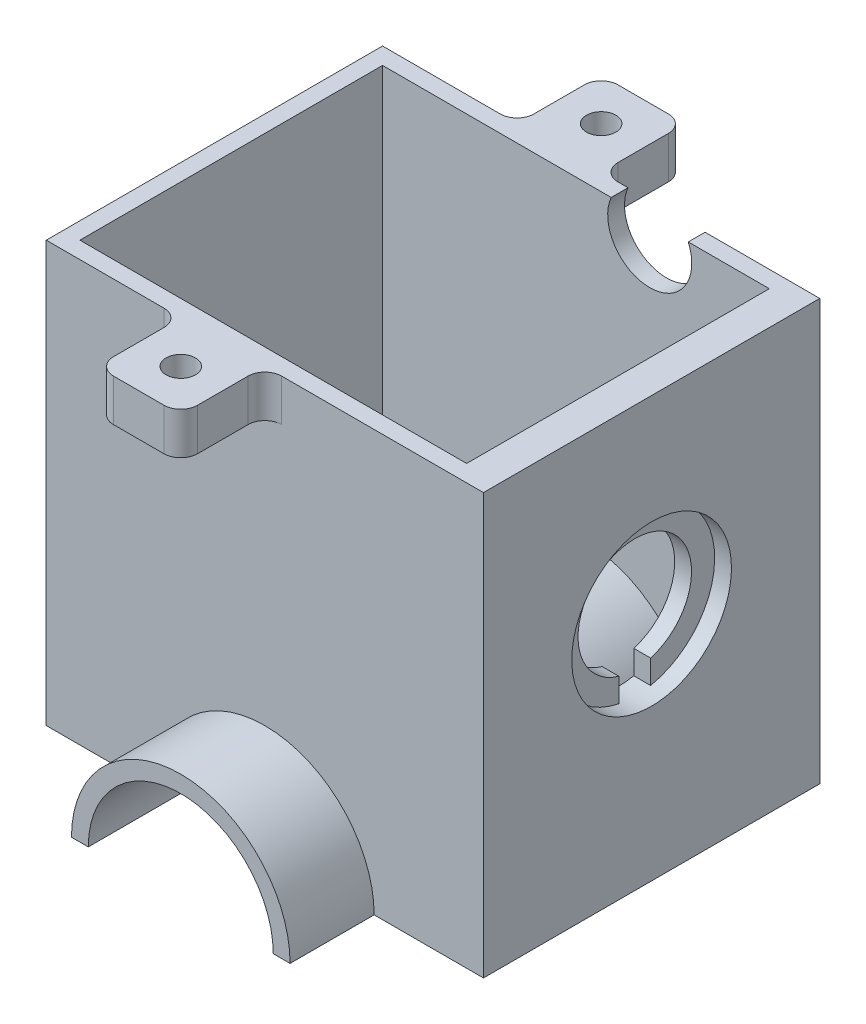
ISO-10303-21;
HEADER;
FILE_DESCRIPTION(('STEP AP214'),'2;1');
FILE_NAME('part.step','',(''),(''),'','','');
FILE_SCHEMA(('AUTOMOTIVE_DESIGN { 1 0 10303 214 1 1 1 1 }'));
ENDSEC;
DATA;
#1=APPLICATION_CONTEXT('core data for automotive mechanical design processes');
#2=APPLICATION_PROTOCOL_DEFINITION('international standard','automotive_design',2000,#1);
#3=PRODUCT_CONTEXT('',#1,'mechanical');
#4=PRODUCT('Part','Part','',(#3));
#5=PRODUCT_RELATED_PRODUCT_CATEGORY('part','',(#4));
#6=PRODUCT_DEFINITION_FORMATION('','',#4);
#7=PRODUCT_DEFINITION_CONTEXT('part definition',#1,'design');
#8=PRODUCT_DEFINITION('design','',#6,#7);
#9=PRODUCT_DEFINITION_SHAPE('','',#8);
#10=(LENGTH_UNIT() NAMED_UNIT(*) SI_UNIT(.MILLI.,.METRE.));
#11=(NAMED_UNIT(*) PLANE_ANGLE_UNIT() SI_UNIT($,.RADIAN.));
#12=(NAMED_UNIT(*) SI_UNIT($,.STERADIAN.) SOLID_ANGLE_UNIT());
#13=UNCERTAINTY_MEASURE_WITH_UNIT(LENGTH_MEASURE(1.E-05),#10,'distance_accuracy_value','');
#14=(GEOMETRIC_REPRESENTATION_CONTEXT(3) GLOBAL_UNCERTAINTY_ASSIGNED_CONTEXT((#13)) GLOBAL_UNIT_ASSIGNED_CONTEXT((#10,
#11,#12)) REPRESENTATION_CONTEXT('',''));
#15=CARTESIAN_POINT('',(0.,0.,0.));
#16=DIRECTION('',(0.,0.,1.));
#17=DIRECTION('',(1.,0.,0.));
#18=AXIS2_PLACEMENT_3D('',#15,#16,#17);
#19=CARTESIAN_POINT('',(0.,0.,40.));
#20=DIRECTION('',(0.,0.,1.));
#21=DIRECTION('',(1.,0.,0.));
#22=AXIS2_PLACEMENT_3D('',#19,#20,#21);
#23=PLANE('',#22);
#24=DIRECTION('',(-1.,0.,0.));
#25=VECTOR('',#24,1.);
#26=CARTESIAN_POINT('',(0.,0.,40.));
#27=LINE('',#26,#25);
#28=CARTESIAN_POINT('',(-13.,0.,40.));
#29=VERTEX_POINT('',#28);
#30=CARTESIAN_POINT('',(-26.,0.,40.));
#31=VERTEX_POINT('',#30);
#32=EDGE_CURVE('E845',#29,#31,#27,.T.);
#33=ORIENTED_EDGE('',*,*,#32,.F.);
#34=CARTESIAN_POINT('',(0.,0.,40.));
#35=DIRECTION('',(0.,0.,1.));
#36=DIRECTION('',(1.,0.,0.));
#37=AXIS2_PLACEMENT_3D('',#34,#35,#36);
#38=CIRCLE('',#37,13.);
#39=CARTESIAN_POINT('',(13.,0.,40.));
#40=VERTEX_POINT('',#39);
#41=EDGE_CURVE('E451',#40,#29,#38,.T.);
#42=ORIENTED_EDGE('',*,*,#41,.F.);
#43=DIRECTION('',(1.,0.,0.));
#44=VECTOR('',#43,1.);
#45=CARTESIAN_POINT('',(0.,0.,40.));
#46=LINE('',#45,#44);
#47=CARTESIAN_POINT('',(26.,0.,40.));
#48=VERTEX_POINT('',#47);
#49=EDGE_CURVE('E456',#40,#48,#46,.T.);
#50=ORIENTED_EDGE('',*,*,#49,.T.);
#51=DIRECTION('',(0.,-1.,0.));
#52=VECTOR('',#51,1.);
#53=CARTESIAN_POINT('',(26.,0.,40.));
#54=LINE('',#53,#52);
#55=CARTESIAN_POINT('',(26.,50.,40.));
#56=VERTEX_POINT('',#55);
#57=EDGE_CURVE('E834',#56,#48,#54,.T.);
#58=ORIENTED_EDGE('',*,*,#57,.F.);
#59=DIRECTION('',(1.,0.,0.));
#60=VECTOR('',#59,1.);
#61=CARTESIAN_POINT('',(0.,50.,40.));
#62=LINE('',#61,#60);
#63=CARTESIAN_POINT('',(2.,50.,40.));
#64=VERTEX_POINT('',#63);
#65=EDGE_CURVE('E838',#64,#56,#62,.T.);
#66=ORIENTED_EDGE('',*,*,#65,.F.);
#67=DIRECTION('',(0.,1.,0.));
#68=VECTOR('',#67,1.);
#69=CARTESIAN_POINT('',(1.99999999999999,0.,40.));
#70=LINE('',#69,#68);
#71=CARTESIAN_POINT('',(2.,45.,40.));
#72=VERTEX_POINT('',#71);
#73=EDGE_CURVE('E891',#64,#72,#70,.F.);
#74=ORIENTED_EDGE('',*,*,#73,.T.);
#75=DIRECTION('',(1.,0.,0.));
#76=VECTOR('',#75,1.);
#77=CARTESIAN_POINT('',(0.,45.,40.));
#78=LINE('',#77,#76);
#79=CARTESIAN_POINT('',(-12.,45.,40.));
#80=VERTEX_POINT('',#79);
#81=EDGE_CURVE('E558',#80,#72,#78,.T.);
#82=ORIENTED_EDGE('',*,*,#81,.F.);
#83=DIRECTION('',(0.,-1.,0.));
#84=VECTOR('',#83,1.);
#85=CARTESIAN_POINT('',(-12.,0.,40.));
#86=LINE('',#85,#84);
#87=CARTESIAN_POINT('',(-12.,50.,40.));
#88=VERTEX_POINT('',#87);
#89=EDGE_CURVE('E889',#80,#88,#86,.F.);
#90=ORIENTED_EDGE('',*,*,#89,.T.);
#91=CARTESIAN_POINT('',(-26.,50.,40.));
#92=VERTEX_POINT('',#91);
#93=EDGE_CURVE('E839',#92,#88,#62,.T.);
#94=ORIENTED_EDGE('',*,*,#93,.F.);
#95=DIRECTION('',(0.,1.,0.));
#96=VECTOR('',#95,1.);
#97=CARTESIAN_POINT('',(-26.,0.,40.));
#98=LINE('',#97,#96);
#99=EDGE_CURVE('E842',#31,#92,#98,.T.);
#100=ORIENTED_EDGE('',*,*,#99,.F.);
#101=EDGE_LOOP('',(#33,#42,#50,#58,#66,#74,#82,#90,#94,#100));
#102=FACE_BOUND('',#101,.T.);
#103=ADVANCED_FACE('F43',(#102),#23,.T.);
#104=CARTESIAN_POINT('',(0.,0.,0.));
#105=DIRECTION('',(0.,0.,1.));
#106=DIRECTION('',(1.,0.,0.));
#107=AXIS2_PLACEMENT_3D('',#104,#105,#106);
#108=PLANE('',#107);
#109=CARTESIAN_POINT('',(0.,0.,0.));
#110=DIRECTION('',(0.,0.,-1.));
#111=DIRECTION('',(-1.,0.,0.));
#112=AXIS2_PLACEMENT_3D('',#109,#110,#111);
#113=CIRCLE('',#112,13.);
#114=CARTESIAN_POINT('',(-13.,0.,0.));
#115=VERTEX_POINT('',#114);
#116=CARTESIAN_POINT('',(13.,0.,0.));
#117=VERTEX_POINT('',#116);
#118=EDGE_CURVE('E457',#115,#117,#113,.T.);
#119=ORIENTED_EDGE('',*,*,#118,.F.);
#120=DIRECTION('',(-1.,0.,0.));
#121=VECTOR('',#120,1.);
#122=CARTESIAN_POINT('',(0.,0.,0.));
#123=LINE('',#122,#121);
#124=CARTESIAN_POINT('',(-26.,0.,0.));
#125=VERTEX_POINT('',#124);
#126=EDGE_CURVE('E835',#115,#125,#123,.T.);
#127=ORIENTED_EDGE('',*,*,#126,.T.);
#128=DIRECTION('',(0.,1.,0.));
#129=VECTOR('',#128,1.);
#130=CARTESIAN_POINT('',(-26.,0.,0.));
#131=LINE('',#130,#129);
#132=CARTESIAN_POINT('',(-26.,50.,0.));
#133=VERTEX_POINT('',#132);
#134=EDGE_CURVE('E855',#125,#133,#131,.T.);
#135=ORIENTED_EDGE('',*,*,#134,.T.);
#136=DIRECTION('',(1.,0.,0.));
#137=VECTOR('',#136,1.);
#138=CARTESIAN_POINT('',(0.,50.,0.));
#139=LINE('',#138,#137);
#140=CARTESIAN_POINT('',(-12.,50.,0.));
#141=VERTEX_POINT('',#140);
#142=EDGE_CURVE('E852',#133,#141,#139,.T.);
#143=ORIENTED_EDGE('',*,*,#142,.T.);
#144=DIRECTION('',(0.,1.,0.));
#145=VECTOR('',#144,1.);
#146=CARTESIAN_POINT('',(-12.,45.,0.));
#147=LINE('',#146,#145);
#148=CARTESIAN_POINT('',(-12.,45.,0.));
#149=VERTEX_POINT('',#148);
#150=EDGE_CURVE('E924',#141,#149,#147,.F.);
#151=ORIENTED_EDGE('',*,*,#150,.T.);
#152=DIRECTION('',(-1.,0.,0.));
#153=VECTOR('',#152,1.);
#154=CARTESIAN_POINT('',(0.,45.,0.));
#155=LINE('',#154,#153);
#156=CARTESIAN_POINT('',(2.,45.,0.));
#157=VERTEX_POINT('',#156);
#158=EDGE_CURVE('E634',#157,#149,#155,.T.);
#159=ORIENTED_EDGE('',*,*,#158,.F.);
#160=DIRECTION('',(0.,-1.,0.));
#161=VECTOR('',#160,1.);
#162=CARTESIAN_POINT('',(2.,50.,0.));
#163=LINE('',#162,#161);
#164=CARTESIAN_POINT('',(2.,50.,0.));
#165=VERTEX_POINT('',#164);
#166=EDGE_CURVE('E922',#157,#165,#163,.F.);
#167=ORIENTED_EDGE('',*,*,#166,.T.);
#168=CARTESIAN_POINT('',(3.19481664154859,50.,0.));
#169=VERTEX_POINT('',#168);
#170=EDGE_CURVE('E856',#165,#169,#139,.T.);
#171=ORIENTED_EDGE('',*,*,#170,.T.);
#172=CARTESIAN_POINT('',(7.77739233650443,48.,0.));
#173=DIRECTION('',(0.,0.,-1.));
#174=DIRECTION('',(-1.,0.,0.));
#175=AXIS2_PLACEMENT_3D('',#172,#173,#174);
#176=CIRCLE('',#175,5.);
#177=CARTESIAN_POINT('',(12.3599680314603,50.,0.));
#178=VERTEX_POINT('',#177);
#179=EDGE_CURVE('E65',#178,#169,#176,.T.);
#180=ORIENTED_EDGE('',*,*,#179,.F.);
#181=CARTESIAN_POINT('',(26.,50.,0.));
#182=VERTEX_POINT('',#181);
#183=EDGE_CURVE('E851',#178,#182,#139,.T.);
#184=ORIENTED_EDGE('',*,*,#183,.T.);
#185=DIRECTION('',(0.,-1.,0.));
#186=VECTOR('',#185,1.);
#187=CARTESIAN_POINT('',(26.,0.,0.));
#188=LINE('',#187,#186);
#189=CARTESIAN_POINT('',(26.,0.,0.));
#190=VERTEX_POINT('',#189);
#191=EDGE_CURVE('E849',#182,#190,#188,.T.);
#192=ORIENTED_EDGE('',*,*,#191,.T.);
#193=DIRECTION('',(1.,0.,0.));
#194=VECTOR('',#193,1.);
#195=CARTESIAN_POINT('',(0.,0.,0.));
#196=LINE('',#195,#194);
#197=EDGE_CURVE('E58',#117,#190,#196,.T.);
#198=ORIENTED_EDGE('',*,*,#197,.F.);
#199=EDGE_LOOP('',(#119,#127,#135,#143,#151,#159,#167,#171,#180,#184,#192,#198));
#200=FACE_BOUND('',#199,.T.);
#201=ADVANCED_FACE('F999',(#200),#108,.F.);
#202=CARTESIAN_POINT('',(26.,27.5,20.));
#203=DIRECTION('',(-1.,0.,0.));
#204=DIRECTION('',(0.,0.,1.));
#205=AXIS2_PLACEMENT_3D('',#202,#203,#204);
#206=CYLINDRICAL_SURFACE('',#205,6.75);
#207=DIRECTION('',(1.,0.,0.));
#208=VECTOR('',#207,1.);
#209=CARTESIAN_POINT('',(14.,21.0175146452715,18.1185421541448));
#210=LINE('',#209,#208);
#211=CARTESIAN_POINT('',(22.,21.0175146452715,18.1185421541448));
#212=VERTEX_POINT('',#211);
#213=CARTESIAN_POINT('',(24.,21.0175146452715,18.1185421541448));
#214=VERTEX_POINT('',#213);
#215=EDGE_CURVE('E488',#212,#214,#210,.T.);
#216=ORIENTED_EDGE('',*,*,#215,.T.);
#217=CARTESIAN_POINT('',(24.,27.5,20.));
#218=DIRECTION('',(1.,0.,0.));
#219=DIRECTION('',(0.,1.,0.));
#220=AXIS2_PLACEMENT_3D('',#217,#218,#219);
#221=CIRCLE('',#220,6.75);
#222=CARTESIAN_POINT('',(24.,21.0175146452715,21.8814578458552));
#223=VERTEX_POINT('',#222);
#224=EDGE_CURVE('E658',#223,#214,#221,.F.);
#225=ORIENTED_EDGE('',*,*,#224,.F.);
#226=DIRECTION('',(1.,0.,0.));
#227=VECTOR('',#226,1.);
#228=CARTESIAN_POINT('',(14.,21.0175146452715,21.8814578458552));
#229=LINE('',#228,#227);
#230=CARTESIAN_POINT('',(22.,21.0175146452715,21.8814578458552));
#231=VERTEX_POINT('',#230);
#232=EDGE_CURVE('E495',#231,#223,#229,.T.);
#233=ORIENTED_EDGE('',*,*,#232,.F.);
#234=CARTESIAN_POINT('',(22.,27.5,20.));
#235=DIRECTION('',(-1.,0.,0.));
#236=DIRECTION('',(0.,0.,1.));
#237=AXIS2_PLACEMENT_3D('',#234,#235,#236);
#238=CIRCLE('',#237,6.75);
#239=EDGE_CURVE('E661',#231,#212,#238,.T.);
#240=ORIENTED_EDGE('',*,*,#239,.T.);
#241=EDGE_LOOP('',(#216,#225,#233,#240));
#242=FACE_BOUND('',#241,.T.);
#243=ADVANCED_FACE('F1109',(#242),#206,.F.);
#244=CARTESIAN_POINT('',(22.,50.,2.));
#245=DIRECTION('',(1.,0.,0.));
#246=DIRECTION('',(0.,0.,-1.));
#247=AXIS2_PLACEMENT_3D('',#244,#245,#246);
#248=PLANE('',#247);
#249=DIRECTION('',(0.,0.,1.));
#250=VECTOR('',#249,1.);
#251=CARTESIAN_POINT('',(22.,5.,2.));
#252=LINE('',#251,#250);
#253=CARTESIAN_POINT('',(22.,5.,2.));
#254=VERTEX_POINT('',#253);
#255=CARTESIAN_POINT('',(22.,5.,38.));
#256=VERTEX_POINT('',#255);
#257=EDGE_CURVE('E664',#254,#256,#252,.T.);
#258=ORIENTED_EDGE('',*,*,#257,.T.);
#259=DIRECTION('',(0.,-1.,0.));
#260=VECTOR('',#259,1.);
#261=CARTESIAN_POINT('',(22.,50.,38.));
#262=LINE('',#261,#260);
#263=CARTESIAN_POINT('',(22.,50.,38.));
#264=VERTEX_POINT('',#263);
#265=EDGE_CURVE('E667',#264,#256,#262,.T.);
#266=ORIENTED_EDGE('',*,*,#265,.F.);
#267=DIRECTION('',(0.,0.,1.));
#268=VECTOR('',#267,1.);
#269=CARTESIAN_POINT('',(22.,50.,2.));
#270=LINE('',#269,#268);
#271=CARTESIAN_POINT('',(22.,50.,2.));
#272=VERTEX_POINT('',#271);
#273=EDGE_CURVE('E665',#272,#264,#270,.T.);
#274=ORIENTED_EDGE('',*,*,#273,.F.);
#275=DIRECTION('',(0.,-1.,0.));
#276=VECTOR('',#275,1.);
#277=CARTESIAN_POINT('',(22.,50.,2.));
#278=LINE('',#277,#276);
#279=EDGE_CURVE('E671',#272,#254,#278,.T.);
#280=ORIENTED_EDGE('',*,*,#279,.T.);
#281=EDGE_LOOP('',(#258,#266,#274,#280));
#282=FACE_BOUND('',#281,.T.);
#283=DIRECTION('',(0.,-1.,0.));
#284=VECTOR('',#283,1.);
#285=CARTESIAN_POINT('',(22.,50.,18.1185421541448));
#286=LINE('',#285,#284);
#287=CARTESIAN_POINT('',(22.,18.1881733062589,18.1185421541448));
#288=VERTEX_POINT('',#287);
#289=EDGE_CURVE('E504',#212,#288,#286,.T.);
#290=ORIENTED_EDGE('',*,*,#289,.F.);
#291=ORIENTED_EDGE('',*,*,#239,.F.);
#292=DIRECTION('',(0.,-1.,0.));
#293=VECTOR('',#292,1.);
#294=CARTESIAN_POINT('',(22.,50.,21.8814578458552));
#295=LINE('',#294,#293);
#296=CARTESIAN_POINT('',(22.,18.1881733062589,21.8814578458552));
#297=VERTEX_POINT('',#296);
#298=EDGE_CURVE('E491',#231,#297,#295,.T.);
#299=ORIENTED_EDGE('',*,*,#298,.T.);
#300=CARTESIAN_POINT('',(22.,27.5,20.));
#301=DIRECTION('',(1.,0.,0.));
#302=DIRECTION('',(0.,0.,-1.));
#303=AXIS2_PLACEMENT_3D('',#300,#301,#302);
#304=CIRCLE('',#303,9.5);
#305=EDGE_CURVE('E501',#297,#288,#304,.T.);
#306=ORIENTED_EDGE('',*,*,#305,.T.);
#307=EDGE_LOOP('',(#290,#291,#299,#306));
#308=FACE_BOUND('',#307,.T.);
#309=ADVANCED_FACE('F995',(#282,#308),#248,.F.);
#310=CARTESIAN_POINT('',(24.,27.5,20.));
#311=DIRECTION('',(1.,0.,0.));
#312=DIRECTION('',(0.,1.,0.));
#313=AXIS2_PLACEMENT_3D('',#310,#311,#312);
#314=PLANE('',#313);
#315=ORIENTED_EDGE('',*,*,#224,.T.);
#316=DIRECTION('',(0.,-1.,0.));
#317=VECTOR('',#316,1.);
#318=CARTESIAN_POINT('',(24.,0.,18.1185421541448));
#319=LINE('',#318,#317);
#320=CARTESIAN_POINT('',(24.,18.1881733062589,18.1185421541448));
#321=VERTEX_POINT('',#320);
#322=EDGE_CURVE('E483',#214,#321,#319,.T.);
#323=ORIENTED_EDGE('',*,*,#322,.T.);
#324=CARTESIAN_POINT('',(24.,27.5,20.));
#325=DIRECTION('',(1.,0.,0.));
#326=DIRECTION('',(0.,1.,0.));
#327=AXIS2_PLACEMENT_3D('',#324,#325,#326);
#328=CIRCLE('',#327,9.5);
#329=CARTESIAN_POINT('',(24.,18.1881733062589,21.8814578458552));
#330=VERTEX_POINT('',#329);
#331=EDGE_CURVE('E655',#321,#330,#328,.T.);
#332=ORIENTED_EDGE('',*,*,#331,.T.);
#333=DIRECTION('',(0.,-1.,0.));
#334=VECTOR('',#333,1.);
#335=CARTESIAN_POINT('',(24.,0.,21.8814578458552));
#336=LINE('',#335,#334);
#337=EDGE_CURVE('E486',#223,#330,#336,.T.);
#338=ORIENTED_EDGE('',*,*,#337,.F.);
#339=EDGE_LOOP('',(#315,#323,#332,#338));
#340=FACE_BOUND('',#339,.T.);
#341=ADVANCED_FACE('F1243',(#340),#314,.T.);
#342=CARTESIAN_POINT('',(0.,0.,38.));
#343=DIRECTION('',(0.,0.,1.));
#344=DIRECTION('',(1.,0.,0.));
#345=AXIS2_PLACEMENT_3D('',#342,#343,#344);
#346=PLANE('',#345);
#347=ORIENTED_EDGE('',*,*,#265,.T.);
#348=DIRECTION('',(-1.,0.,0.));
#349=VECTOR('',#348,1.);
#350=CARTESIAN_POINT('',(0.,5.,38.));
#351=LINE('',#350,#349);
#352=CARTESIAN_POINT('',(12.,5.,38.));
#353=VERTEX_POINT('',#352);
#354=EDGE_CURVE('E794',#256,#353,#351,.T.);
#355=ORIENTED_EDGE('',*,*,#354,.T.);
#356=CARTESIAN_POINT('',(0.,0.,38.));
#357=DIRECTION('',(0.,0.,1.));
#358=DIRECTION('',(1.,0.,0.));
#359=AXIS2_PLACEMENT_3D('',#356,#357,#358);
#360=CIRCLE('',#359,13.);
#361=CARTESIAN_POINT('',(0.,13.,38.));
#362=VERTEX_POINT('',#361);
#363=EDGE_CURVE('E818',#353,#362,#360,.T.);
#364=ORIENTED_EDGE('',*,*,#363,.T.);
#365=DIRECTION('',(-1.,0.,0.));
#366=VECTOR('',#365,1.);
#367=CARTESIAN_POINT('',(0.,13.,38.));
#368=LINE('',#367,#366);
#369=CARTESIAN_POINT('',(-24.,13.,38.));
#370=VERTEX_POINT('',#369);
#371=EDGE_CURVE('E804',#362,#370,#368,.T.);
#372=ORIENTED_EDGE('',*,*,#371,.T.);
#373=DIRECTION('',(0.,1.,0.));
#374=VECTOR('',#373,1.);
#375=CARTESIAN_POINT('',(-24.,0.,38.));
#376=LINE('',#375,#374);
#377=CARTESIAN_POINT('',(-24.,50.,38.));
#378=VERTEX_POINT('',#377);
#379=EDGE_CURVE('E822',#370,#378,#376,.T.);
#380=ORIENTED_EDGE('',*,*,#379,.T.);
#381=DIRECTION('',(1.,0.,0.));
#382=VECTOR('',#381,1.);
#383=CARTESIAN_POINT('',(0.,50.,38.));
#384=LINE('',#383,#382);
#385=EDGE_CURVE('E820',#378,#264,#384,.T.);
#386=ORIENTED_EDGE('',*,*,#385,.T.);
#387=EDGE_LOOP('',(#347,#355,#364,#372,#380,#386));
#388=FACE_BOUND('',#387,.T.);
#389=ADVANCED_FACE('F1246',(#388),#346,.F.);
#390=CARTESIAN_POINT('',(0.,0.,2.));
#391=DIRECTION('',(0.,0.,1.));
#392=DIRECTION('',(1.,0.,0.));
#393=AXIS2_PLACEMENT_3D('',#390,#391,#392);
#394=PLANE('',#393);
#395=CARTESIAN_POINT('',(7.77739233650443,48.,2.));
#396=DIRECTION('',(0.,0.,1.));
#397=DIRECTION('',(1.,0.,0.));
#398=AXIS2_PLACEMENT_3D('',#395,#396,#397);
#399=CIRCLE('',#398,5.);
#400=CARTESIAN_POINT('',(3.19481664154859,50.,2.));
#401=VERTEX_POINT('',#400);
#402=CARTESIAN_POINT('',(12.3599680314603,50.,2.));
#403=VERTEX_POINT('',#402);
#404=EDGE_CURVE('E481',#401,#403,#399,.T.);
#405=ORIENTED_EDGE('',*,*,#404,.F.);
#406=DIRECTION('',(1.,0.,0.));
#407=VECTOR('',#406,1.);
#408=CARTESIAN_POINT('',(0.,50.,2.));
#409=LINE('',#408,#407);
#410=CARTESIAN_POINT('',(-24.,50.,2.));
#411=VERTEX_POINT('',#410);
#412=EDGE_CURVE('E826',#411,#401,#409,.T.);
#413=ORIENTED_EDGE('',*,*,#412,.F.);
#414=DIRECTION('',(0.,1.,0.));
#415=VECTOR('',#414,1.);
#416=CARTESIAN_POINT('',(-24.,0.,2.));
#417=LINE('',#416,#415);
#418=CARTESIAN_POINT('',(-24.,13.,2.));
#419=VERTEX_POINT('',#418);
#420=EDGE_CURVE('E821',#419,#411,#417,.T.);
#421=ORIENTED_EDGE('',*,*,#420,.F.);
#422=DIRECTION('',(-1.,0.,0.));
#423=VECTOR('',#422,1.);
#424=CARTESIAN_POINT('',(0.,13.,2.));
#425=LINE('',#424,#423);
#426=CARTESIAN_POINT('',(0.,13.,2.));
#427=VERTEX_POINT('',#426);
#428=EDGE_CURVE('E805',#427,#419,#425,.T.);
#429=ORIENTED_EDGE('',*,*,#428,.F.);
#430=CARTESIAN_POINT('',(0.,0.,2.));
#431=DIRECTION('',(0.,0.,1.));
#432=DIRECTION('',(1.,0.,0.));
#433=AXIS2_PLACEMENT_3D('',#430,#431,#432);
#434=CIRCLE('',#433,13.);
#435=CARTESIAN_POINT('',(12.,5.,2.));
#436=VERTEX_POINT('',#435);
#437=EDGE_CURVE('E815',#436,#427,#434,.T.);
#438=ORIENTED_EDGE('',*,*,#437,.F.);
#439=DIRECTION('',(-1.,0.,0.));
#440=VECTOR('',#439,1.);
#441=CARTESIAN_POINT('',(0.,5.,2.));
#442=LINE('',#441,#440);
#443=EDGE_CURVE('E798',#254,#436,#442,.T.);
#444=ORIENTED_EDGE('',*,*,#443,.F.);
#445=ORIENTED_EDGE('',*,*,#279,.F.);
#446=EDGE_CURVE('E817',#403,#272,#409,.T.);
#447=ORIENTED_EDGE('',*,*,#446,.F.);
#448=EDGE_LOOP('',(#405,#413,#421,#429,#438,#444,#445,#447));
#449=FACE_BOUND('',#448,.T.);
#450=ADVANCED_FACE('F968',(#449),#394,.T.);
#451=CARTESIAN_POINT('',(0.,5.,2.));
#452=DIRECTION('',(0.,1.,0.));
#453=DIRECTION('',(0.,0.,1.));
#454=AXIS2_PLACEMENT_3D('',#451,#452,#453);
#455=PLANE('',#454);
#456=DIRECTION('',(0.866025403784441,0.,0.499999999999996));
#457=VECTOR('',#456,1.);
#458=CARTESIAN_POINT('',(15.5,5.,21.7320508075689));
#459=LINE('',#458,#457);
#460=CARTESIAN_POINT('',(15.5,5.,21.7320508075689));
#461=VERTEX_POINT('',#460);
#462=CARTESIAN_POINT('',(18.5,5.,23.4641016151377));
#463=VERTEX_POINT('',#462);
#464=EDGE_CURVE('E762',#461,#463,#459,.T.);
#465=ORIENTED_EDGE('',*,*,#464,.F.);
#466=DIRECTION('',(0.,0.,1.));
#467=VECTOR('',#466,1.);
#468=CARTESIAN_POINT('',(15.5,5.,18.2679491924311));
#469=LINE('',#468,#467);
#470=CARTESIAN_POINT('',(15.5,5.,18.2679491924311));
#471=VERTEX_POINT('',#470);
#472=EDGE_CURVE('E746',#471,#461,#469,.T.);
#473=ORIENTED_EDGE('',*,*,#472,.F.);
#474=DIRECTION('',(-0.866025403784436,0.,0.500000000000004));
#475=VECTOR('',#474,1.);
#476=CARTESIAN_POINT('',(18.5,5.,16.5358983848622));
#477=LINE('',#476,#475);
#478=CARTESIAN_POINT('',(18.5,5.,16.5358983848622));
#479=VERTEX_POINT('',#478);
#480=EDGE_CURVE('E773',#479,#471,#477,.T.);
#481=ORIENTED_EDGE('',*,*,#480,.F.);
#482=DIRECTION('',(-0.866025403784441,0.,-0.499999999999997));
#483=VECTOR('',#482,1.);
#484=CARTESIAN_POINT('',(21.5,5.,18.2679491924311));
#485=LINE('',#484,#483);
#486=CARTESIAN_POINT('',(21.5,5.,18.2679491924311));
#487=VERTEX_POINT('',#486);
#488=EDGE_CURVE('E770',#487,#479,#485,.T.);
#489=ORIENTED_EDGE('',*,*,#488,.F.);
#490=DIRECTION('',(0.,0.,-1.));
#491=VECTOR('',#490,1.);
#492=CARTESIAN_POINT('',(21.5,5.,21.7320508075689));
#493=LINE('',#492,#491);
#494=CARTESIAN_POINT('',(21.5,5.,21.7320508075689));
#495=VERTEX_POINT('',#494);
#496=EDGE_CURVE('E767',#495,#487,#493,.T.);
#497=ORIENTED_EDGE('',*,*,#496,.F.);
#498=DIRECTION('',(0.866025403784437,0.,-0.500000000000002));
#499=VECTOR('',#498,1.);
#500=CARTESIAN_POINT('',(18.5,5.,23.4641016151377));
#501=LINE('',#500,#499);
#502=EDGE_CURVE('E764',#463,#495,#501,.T.);
#503=ORIENTED_EDGE('',*,*,#502,.F.);
#504=EDGE_LOOP('',(#465,#473,#481,#489,#497,#503));
#505=FACE_BOUND('',#504,.T.);
#506=ORIENTED_EDGE('',*,*,#354,.F.);
#507=ORIENTED_EDGE('',*,*,#257,.F.);
#508=ORIENTED_EDGE('',*,*,#443,.T.);
#509=DIRECTION('',(0.,0.,1.));
#510=VECTOR('',#509,1.);
#511=CARTESIAN_POINT('',(12.,5.,2.));
#512=LINE('',#511,#510);
#513=EDGE_CURVE('E800',#436,#353,#512,.T.);
#514=ORIENTED_EDGE('',*,*,#513,.T.);
#515=EDGE_LOOP('',(#506,#507,#508,#514));
#516=FACE_BOUND('',#515,.T.);
#517=ADVANCED_FACE('F991',(#505,#516),#455,.T.);
#518=CARTESIAN_POINT('',(-17.0819741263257,0.,27.62));
#519=DIRECTION('',(0.,1.,0.));
#520=DIRECTION('',(0.,0.,1.));
#521=AXIS2_PLACEMENT_3D('',#518,#519,#520);
#522=CYLINDRICAL_SURFACE('',#521,1.27);
#523=CARTESIAN_POINT('',(-17.0819741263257,13.,27.62));
#524=DIRECTION('',(0.,1.,0.));
#525=DIRECTION('',(0.,0.,1.));
#526=AXIS2_PLACEMENT_3D('',#523,#524,#525);
#527=CIRCLE('',#526,1.27);
#528=CARTESIAN_POINT('',(-17.0819741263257,13.,28.89));
#529=VERTEX_POINT('',#528);
#530=EDGE_CURVE('E690',#529,#529,#527,.T.);
#531=ORIENTED_EDGE('',*,*,#530,.T.);
#532=EDGE_LOOP('',(#531));
#533=FACE_BOUND('',#532,.T.);
#534=CARTESIAN_POINT('',(-17.0819741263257,11.,27.62));
#535=DIRECTION('',(0.,-1.,0.));
#536=DIRECTION('',(1.,0.,0.));
#537=AXIS2_PLACEMENT_3D('',#534,#535,#536);
#538=CIRCLE('',#537,1.27);
#539=CARTESIAN_POINT('',(-15.8119741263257,11.,27.62));
#540=VERTEX_POINT('',#539);
#541=EDGE_CURVE('E693',#540,#540,#538,.F.);
#542=ORIENTED_EDGE('',*,*,#541,.F.);
#543=EDGE_LOOP('',(#542));
#544=FACE_BOUND('',#543,.T.);
#545=ADVANCED_FACE('F1275',(#533,#544),#522,.F.);
#546=CARTESIAN_POINT('',(-17.0819741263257,0.,12.38));
#547=DIRECTION('',(0.,1.,0.));
#548=DIRECTION('',(0.,0.,1.));
#549=AXIS2_PLACEMENT_3D('',#546,#547,#548);
#550=CYLINDRICAL_SURFACE('',#549,1.27);
#551=CARTESIAN_POINT('',(-17.0819741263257,13.,12.38));
#552=DIRECTION('',(0.,1.,0.));
#553=DIRECTION('',(0.,0.,1.));
#554=AXIS2_PLACEMENT_3D('',#551,#552,#553);
#555=CIRCLE('',#554,1.27);
#556=CARTESIAN_POINT('',(-17.0819741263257,13.,13.65));
#557=VERTEX_POINT('',#556);
#558=EDGE_CURVE('E686',#557,#557,#555,.T.);
#559=ORIENTED_EDGE('',*,*,#558,.T.);
#560=EDGE_LOOP('',(#559));
#561=FACE_BOUND('',#560,.T.);
#562=CARTESIAN_POINT('',(-17.0819741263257,11.,12.38));
#563=DIRECTION('',(0.,-1.,0.));
#564=DIRECTION('',(1.,0.,0.));
#565=AXIS2_PLACEMENT_3D('',#562,#563,#564);
#566=CIRCLE('',#565,1.27);
#567=CARTESIAN_POINT('',(-15.8119741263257,11.,12.38));
#568=VERTEX_POINT('',#567);
#569=EDGE_CURVE('E677',#568,#568,#566,.F.);
#570=ORIENTED_EDGE('',*,*,#569,.F.);
#571=EDGE_LOOP('',(#570));
#572=FACE_BOUND('',#571,.T.);
#573=ADVANCED_FACE('F1271',(#561,#572),#550,.F.);
#574=CARTESIAN_POINT('',(-18.5,36.,20.));
#575=DIRECTION('',(0.,-1.,0.));
#576=DIRECTION('',(0.,0.,-1.));
#577=AXIS2_PLACEMENT_3D('',#574,#575,#576);
#578=CYLINDRICAL_SURFACE('',#577,2.);
#579=CARTESIAN_POINT('',(-18.5,0.,20.));
#580=DIRECTION('',(0.,-1.,0.));
#581=DIRECTION('',(0.,0.,-1.));
#582=AXIS2_PLACEMENT_3D('',#579,#580,#581);
#583=CIRCLE('',#582,2.);
#584=CARTESIAN_POINT('',(-18.5,0.,18.));
#585=VERTEX_POINT('',#584);
#586=EDGE_CURVE('E795',#585,#585,#583,.T.);
#587=ORIENTED_EDGE('',*,*,#586,.T.);
#588=EDGE_LOOP('',(#587));
#589=FACE_BOUND('',#588,.T.);
#590=CARTESIAN_POINT('',(-18.5,2.,20.));
#591=DIRECTION('',(0.,1.,0.));
#592=DIRECTION('',(0.,0.,1.));
#593=AXIS2_PLACEMENT_3D('',#590,#591,#592);
#594=CIRCLE('',#593,2.);
#595=CARTESIAN_POINT('',(-18.5,2.,22.));
#596=VERTEX_POINT('',#595);
#597=EDGE_CURVE('E731',#596,#596,#594,.F.);
#598=ORIENTED_EDGE('',*,*,#597,.F.);
#599=EDGE_LOOP('',(#598));
#600=FACE_BOUND('',#599,.T.);
#601=ADVANCED_FACE('F1274',(#589,#600),#578,.F.);
#602=CARTESIAN_POINT('',(18.5,36.,20.));
#603=DIRECTION('',(0.,-1.,0.));
#604=DIRECTION('',(0.,0.,-1.));
#605=AXIS2_PLACEMENT_3D('',#602,#603,#604);
#606=CYLINDRICAL_SURFACE('',#605,2.00000000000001);
#607=CARTESIAN_POINT('',(18.5,0.,20.));
#608=DIRECTION('',(0.,-1.,0.));
#609=DIRECTION('',(0.,0.,-1.));
#610=AXIS2_PLACEMENT_3D('',#607,#608,#609);
#611=CIRCLE('',#610,2.00000000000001);
#612=CARTESIAN_POINT('',(18.5,0.,18.));
#613=VERTEX_POINT('',#612);
#614=EDGE_CURVE('E791',#613,#613,#611,.T.);
#615=ORIENTED_EDGE('',*,*,#614,.T.);
#616=EDGE_LOOP('',(#615));
#617=FACE_BOUND('',#616,.T.);
#618=CARTESIAN_POINT('',(18.5,2.,20.));
#619=DIRECTION('',(0.,1.,0.));
#620=DIRECTION('',(0.,0.,1.));
#621=AXIS2_PLACEMENT_3D('',#618,#619,#620);
#622=CIRCLE('',#621,2.00000000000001);
#623=CARTESIAN_POINT('',(18.5,2.,22.));
#624=VERTEX_POINT('',#623);
#625=EDGE_CURVE('E780',#624,#624,#622,.F.);
#626=ORIENTED_EDGE('',*,*,#625,.F.);
#627=EDGE_LOOP('',(#626));
#628=FACE_BOUND('',#627,.T.);
#629=ADVANCED_FACE('F1335',(#617,#628),#606,.F.);
#630=CARTESIAN_POINT('',(0.,0.,40.));
#631=DIRECTION('',(0.,0.,-1.));
#632=DIRECTION('',(-1.,0.,0.));
#633=AXIS2_PLACEMENT_3D('',#630,#631,#632);
#634=CYLINDRICAL_SURFACE('',#633,13.);
#635=ORIENTED_EDGE('',*,*,#363,.F.);
#636=ORIENTED_EDGE('',*,*,#513,.F.);
#637=ORIENTED_EDGE('',*,*,#437,.T.);
#638=DIRECTION('',(0.,0.,1.));
#639=VECTOR('',#638,1.);
#640=CARTESIAN_POINT('',(0.,13.,2.));
#641=LINE('',#640,#639);
#642=EDGE_CURVE('E812',#427,#362,#641,.T.);
#643=ORIENTED_EDGE('',*,*,#642,.T.);
#644=EDGE_LOOP('',(#635,#636,#637,#643));
#645=FACE_BOUND('',#644,.T.);
#646=ADVANCED_FACE('F988',(#645),#634,.T.);
#647=CARTESIAN_POINT('',(0.,50.,40.));
#648=DIRECTION('',(0.,1.,0.));
#649=DIRECTION('',(0.,0.,1.));
#650=AXIS2_PLACEMENT_3D('',#647,#648,#649);
#651=PLANE('',#650);
#652=DIRECTION('',(0.,0.,-1.));
#653=VECTOR('',#652,1.);
#654=CARTESIAN_POINT('',(12.3599680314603,50.,10.));
#655=LINE('',#654,#653);
#656=EDGE_CURVE('E11',#403,#178,#655,.T.);
#657=ORIENTED_EDGE('',*,*,#656,.F.);
#658=ORIENTED_EDGE('',*,*,#446,.T.);
#659=ORIENTED_EDGE('',*,*,#273,.T.);
#660=ORIENTED_EDGE('',*,*,#385,.F.);
#661=DIRECTION('',(0.,0.,-1.));
#662=VECTOR('',#661,1.);
#663=CARTESIAN_POINT('',(-24.,50.,40.));
#664=LINE('',#663,#662);
#665=EDGE_CURVE('E824',#378,#411,#664,.T.);
#666=ORIENTED_EDGE('',*,*,#665,.T.);
#667=ORIENTED_EDGE('',*,*,#412,.T.);
#668=DIRECTION('',(0.,0.,-1.));
#669=VECTOR('',#668,1.);
#670=CARTESIAN_POINT('',(3.19481664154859,50.,10.));
#671=LINE('',#670,#669);
#672=EDGE_CURVE('E51',#169,#401,#671,.F.);
#673=ORIENTED_EDGE('',*,*,#672,.F.);
#674=ORIENTED_EDGE('',*,*,#170,.F.);
#675=CARTESIAN_POINT('',(2.,50.,-2.));
#676=DIRECTION('',(0.,1.,0.));
#677=DIRECTION('',(0.,0.,1.));
#678=AXIS2_PLACEMENT_3D('',#675,#676,#677);
#679=CIRCLE('',#678,2.);
#680=CARTESIAN_POINT('',(0.,50.,-2.));
#681=VERTEX_POINT('',#680);
#682=EDGE_CURVE('E958',#165,#681,#679,.F.);
#683=ORIENTED_EDGE('',*,*,#682,.T.);
#684=DIRECTION('',(0.,0.,1.));
#685=VECTOR('',#684,1.);
#686=CARTESIAN_POINT('',(0.,50.,-10.));
#687=LINE('',#686,#685);
#688=CARTESIAN_POINT('',(0.,50.,-8.));
#689=VERTEX_POINT('',#688);
#690=EDGE_CURVE('E641',#689,#681,#687,.T.);
#691=ORIENTED_EDGE('',*,*,#690,.F.);
#692=CARTESIAN_POINT('',(-2.,50.,-8.));
#693=DIRECTION('',(0.,1.,0.));
#694=DIRECTION('',(0.,0.,1.));
#695=AXIS2_PLACEMENT_3D('',#692,#693,#694);
#696=CIRCLE('',#695,2.);
#697=CARTESIAN_POINT('',(-2.,50.,-10.));
#698=VERTEX_POINT('',#697);
#699=EDGE_CURVE('E900',#689,#698,#696,.T.);
#700=ORIENTED_EDGE('',*,*,#699,.T.);
#701=DIRECTION('',(1.,0.,0.));
#702=VECTOR('',#701,1.);
#703=CARTESIAN_POINT('',(0.,50.,-10.));
#704=LINE('',#703,#702);
#705=CARTESIAN_POINT('',(-8.,50.,-10.));
#706=VERTEX_POINT('',#705);
#707=EDGE_CURVE('E638',#706,#698,#704,.T.);
#708=ORIENTED_EDGE('',*,*,#707,.F.);
#709=CARTESIAN_POINT('',(-8.,50.,-8.));
#710=DIRECTION('',(0.,1.,0.));
#711=DIRECTION('',(0.,0.,1.));
#712=AXIS2_PLACEMENT_3D('',#709,#710,#711);
#713=CIRCLE('',#712,2.);
#714=CARTESIAN_POINT('',(-10.,50.,-8.));
#715=VERTEX_POINT('',#714);
#716=EDGE_CURVE('E902',#706,#715,#713,.T.);
#717=ORIENTED_EDGE('',*,*,#716,.T.);
#718=DIRECTION('',(0.,0.,1.));
#719=VECTOR('',#718,1.);
#720=CARTESIAN_POINT('',(-10.,50.,-10.));
#721=LINE('',#720,#719);
#722=CARTESIAN_POINT('',(-10.,50.,-2.));
#723=VERTEX_POINT('',#722);
#724=EDGE_CURVE('E645',#715,#723,#721,.T.);
#725=ORIENTED_EDGE('',*,*,#724,.T.);
#726=CARTESIAN_POINT('',(-12.,50.,-2.));
#727=DIRECTION('',(0.,1.,0.));
#728=DIRECTION('',(0.,0.,1.));
#729=AXIS2_PLACEMENT_3D('',#726,#727,#728);
#730=CIRCLE('',#729,2.);
#731=EDGE_CURVE('E951',#723,#141,#730,.F.);
#732=ORIENTED_EDGE('',*,*,#731,.T.);
#733=ORIENTED_EDGE('',*,*,#142,.F.);
#734=DIRECTION('',(0.,0.,-1.));
#735=VECTOR('',#734,1.);
#736=CARTESIAN_POINT('',(-26.,50.,40.));
#737=LINE('',#736,#735);
#738=EDGE_CURVE('E864',#92,#133,#737,.T.);
#739=ORIENTED_EDGE('',*,*,#738,.F.);
#740=ORIENTED_EDGE('',*,*,#93,.T.);
#741=CARTESIAN_POINT('',(-12.,50.,42.));
#742=DIRECTION('',(0.,1.,0.));
#743=DIRECTION('',(0.,0.,1.));
#744=AXIS2_PLACEMENT_3D('',#741,#742,#743);
#745=CIRCLE('',#744,2.);
#746=CARTESIAN_POINT('',(-10.,50.,42.));
#747=VERTEX_POINT('',#746);
#748=EDGE_CURVE('E949',#88,#747,#745,.F.);
#749=ORIENTED_EDGE('',*,*,#748,.T.);
#750=DIRECTION('',(0.,0.,-1.));
#751=VECTOR('',#750,1.);
#752=CARTESIAN_POINT('',(-10.,50.,50.));
#753=LINE('',#752,#751);
#754=CARTESIAN_POINT('',(-10.,50.,48.));
#755=VERTEX_POINT('',#754);
#756=EDGE_CURVE('E628',#755,#747,#753,.T.);
#757=ORIENTED_EDGE('',*,*,#756,.F.);
#758=CARTESIAN_POINT('',(-8.,50.,48.));
#759=DIRECTION('',(0.,1.,0.));
#760=DIRECTION('',(0.,0.,1.));
#761=AXIS2_PLACEMENT_3D('',#758,#759,#760);
#762=CIRCLE('',#761,2.);
#763=CARTESIAN_POINT('',(-8.,50.,50.));
#764=VERTEX_POINT('',#763);
#765=EDGE_CURVE('E904',#755,#764,#762,.T.);
#766=ORIENTED_EDGE('',*,*,#765,.T.);
#767=DIRECTION('',(-1.,0.,0.));
#768=VECTOR('',#767,1.);
#769=CARTESIAN_POINT('',(0.,50.,50.));
#770=LINE('',#769,#768);
#771=CARTESIAN_POINT('',(-2.,50.,50.));
#772=VERTEX_POINT('',#771);
#773=EDGE_CURVE('E615',#772,#764,#770,.T.);
#774=ORIENTED_EDGE('',*,*,#773,.F.);
#775=CARTESIAN_POINT('',(-2.,50.,48.));
#776=DIRECTION('',(0.,1.,0.));
#777=DIRECTION('',(0.,0.,1.));
#778=AXIS2_PLACEMENT_3D('',#775,#776,#777);
#779=CIRCLE('',#778,2.);
#780=CARTESIAN_POINT('',(0.,50.,48.));
#781=VERTEX_POINT('',#780);
#782=EDGE_CURVE('E906',#772,#781,#779,.T.);
#783=ORIENTED_EDGE('',*,*,#782,.T.);
#784=DIRECTION('',(0.,0.,-1.));
#785=VECTOR('',#784,1.);
#786=CARTESIAN_POINT('',(0.,50.,50.));
#787=LINE('',#786,#785);
#788=CARTESIAN_POINT('',(0.,50.,42.));
#789=VERTEX_POINT('',#788);
#790=EDGE_CURVE('E631',#781,#789,#787,.T.);
#791=ORIENTED_EDGE('',*,*,#790,.T.);
#792=CARTESIAN_POINT('',(2.,50.,42.));
#793=DIRECTION('',(0.,1.,0.));
#794=DIRECTION('',(0.,0.,1.));
#795=AXIS2_PLACEMENT_3D('',#792,#793,#794);
#796=CIRCLE('',#795,2.);
#797=EDGE_CURVE('E942',#789,#64,#796,.F.);
#798=ORIENTED_EDGE('',*,*,#797,.T.);
#799=ORIENTED_EDGE('',*,*,#65,.T.);
#800=DIRECTION('',(0.,0.,-1.));
#801=VECTOR('',#800,1.);
#802=CARTESIAN_POINT('',(26.,50.,40.));
#803=LINE('',#802,#801);
#804=EDGE_CURVE('E866',#56,#182,#803,.T.);
#805=ORIENTED_EDGE('',*,*,#804,.T.);
#806=ORIENTED_EDGE('',*,*,#183,.F.);
#807=EDGE_LOOP('',(#657,#658,#659,#660,#666,#667,#673,#674,#683,#691,#700,#708,#717,#725,#732,
#733,#739,#740,#749,#757,#766,#774,#783,#791,#798,#799,#805,#806));
#808=FACE_BOUND('',#807,.T.);
#809=CARTESIAN_POINT('',(-5.,50.,45.));
#810=DIRECTION('',(0.,-1.,0.));
#811=DIRECTION('',(0.,0.,-1.));
#812=AXIS2_PLACEMENT_3D('',#809,#810,#811);
#813=CIRCLE('',#812,1.75);
#814=CARTESIAN_POINT('',(-5.,50.,43.25));
#815=VERTEX_POINT('',#814);
#816=EDGE_CURVE('E507',#815,#815,#813,.T.);
#817=ORIENTED_EDGE('',*,*,#816,.T.);
#818=EDGE_LOOP('',(#817));
#819=FACE_BOUND('',#818,.T.);
#820=CARTESIAN_POINT('',(-5.,50.,-5.));
#821=DIRECTION('',(0.,-1.,0.));
#822=DIRECTION('',(0.,0.,-1.));
#823=AXIS2_PLACEMENT_3D('',#820,#821,#822);
#824=CIRCLE('',#823,1.75);
#825=CARTESIAN_POINT('',(-5.,50.,-6.75));
#826=VERTEX_POINT('',#825);
#827=EDGE_CURVE('E506',#826,#826,#824,.T.);
#828=ORIENTED_EDGE('',*,*,#827,.T.);
#829=EDGE_LOOP('',(#828));
#830=FACE_BOUND('',#829,.T.);
#831=ADVANCED_FACE('F970',(#808,#819,#830),#651,.T.);
#832=CARTESIAN_POINT('',(0.,0.,40.));
#833=DIRECTION('',(0.,0.,-1.));
#834=DIRECTION('',(-1.,0.,0.));
#835=AXIS2_PLACEMENT_3D('',#832,#833,#834);
#836=CYLINDRICAL_SURFACE('',#835,11.);
#837=DIRECTION('',(0.,0.,-1.));
#838=VECTOR('',#837,1.);
#839=CARTESIAN_POINT('',(-11.,0.,40.));
#840=LINE('',#839,#838);
#841=CARTESIAN_POINT('',(-11.,0.,50.));
#842=VERTEX_POINT('',#841);
#843=CARTESIAN_POINT('',(-11.,0.,-10.));
#844=VERTEX_POINT('',#843);
#845=EDGE_CURVE('E847',#842,#844,#840,.T.);
#846=ORIENTED_EDGE('',*,*,#845,.T.);
#847=CARTESIAN_POINT('',(0.,0.,-10.));
#848=DIRECTION('',(0.,0.,-1.));
#849=DIRECTION('',(-1.,0.,0.));
#850=AXIS2_PLACEMENT_3D('',#847,#848,#849);
#851=CIRCLE('',#850,11.);
#852=CARTESIAN_POINT('',(11.,0.,-10.));
#853=VERTEX_POINT('',#852);
#854=EDGE_CURVE('E471',#853,#844,#851,.F.);
#855=ORIENTED_EDGE('',*,*,#854,.F.);
#856=DIRECTION('',(0.,0.,-1.));
#857=VECTOR('',#856,1.);
#858=CARTESIAN_POINT('',(11.,0.,40.));
#859=LINE('',#858,#857);
#860=CARTESIAN_POINT('',(11.,0.,50.));
#861=VERTEX_POINT('',#860);
#862=EDGE_CURVE('E872',#861,#853,#859,.T.);
#863=ORIENTED_EDGE('',*,*,#862,.F.);
#864=CARTESIAN_POINT('',(0.,0.,50.));
#865=DIRECTION('',(0.,0.,1.));
#866=DIRECTION('',(1.,0.,0.));
#867=AXIS2_PLACEMENT_3D('',#864,#865,#866);
#868=CIRCLE('',#867,11.);
#869=EDGE_CURVE('E449',#842,#861,#868,.F.);
#870=ORIENTED_EDGE('',*,*,#869,.F.);
#871=EDGE_LOOP('',(#846,#855,#863,#870));
#872=FACE_BOUND('',#871,.T.);
#873=ADVANCED_FACE('F1091',(#872),#836,.F.);
#874=CARTESIAN_POINT('',(0.,0.,40.));
#875=DIRECTION('',(0.,1.,0.));
#876=DIRECTION('',(0.,0.,1.));
#877=AXIS2_PLACEMENT_3D('',#874,#875,#876);
#878=PLANE('',#877);
#879=ORIENTED_EDGE('',*,*,#614,.F.);
#880=EDGE_LOOP('',(#879));
#881=FACE_BOUND('',#880,.T.);
#882=ORIENTED_EDGE('',*,*,#862,.T.);
#883=DIRECTION('',(-1.,0.,0.));
#884=VECTOR('',#883,1.);
#885=CARTESIAN_POINT('',(0.,0.,-10.));
#886=LINE('',#885,#884);
#887=CARTESIAN_POINT('',(13.,0.,-10.));
#888=VERTEX_POINT('',#887);
#889=EDGE_CURVE('E468',#888,#853,#886,.T.);
#890=ORIENTED_EDGE('',*,*,#889,.F.);
#891=DIRECTION('',(0.,0.,1.));
#892=VECTOR('',#891,1.);
#893=CARTESIAN_POINT('',(13.,0.,-10.));
#894=LINE('',#893,#892);
#895=EDGE_CURVE('E473',#888,#117,#894,.T.);
#896=ORIENTED_EDGE('',*,*,#895,.T.);
#897=ORIENTED_EDGE('',*,*,#197,.T.);
#898=DIRECTION('',(0.,0.,-1.));
#899=VECTOR('',#898,1.);
#900=CARTESIAN_POINT('',(26.,0.,40.));
#901=LINE('',#900,#899);
#902=EDGE_CURVE('E869',#48,#190,#901,.T.);
#903=ORIENTED_EDGE('',*,*,#902,.F.);
#904=ORIENTED_EDGE('',*,*,#49,.F.);
#905=DIRECTION('',(0.,0.,-1.));
#906=VECTOR('',#905,1.);
#907=CARTESIAN_POINT('',(13.,0.,50.));
#908=LINE('',#907,#906);
#909=CARTESIAN_POINT('',(13.,0.,50.));
#910=VERTEX_POINT('',#909);
#911=EDGE_CURVE('E435',#910,#40,#908,.T.);
#912=ORIENTED_EDGE('',*,*,#911,.F.);
#913=DIRECTION('',(1.,0.,0.));
#914=VECTOR('',#913,1.);
#915=CARTESIAN_POINT('',(0.,0.,50.));
#916=LINE('',#915,#914);
#917=EDGE_CURVE('E443',#861,#910,#916,.T.);
#918=ORIENTED_EDGE('',*,*,#917,.F.);
#919=EDGE_LOOP('',(#882,#890,#896,#897,#903,#904,#912,#918));
#920=FACE_BOUND('',#919,.T.);
#921=ADVANCED_FACE('F454',(#881,#920),#878,.F.);
#922=CARTESIAN_POINT('',(26.,0.,40.));
#923=DIRECTION('',(1.,0.,0.));
#924=DIRECTION('',(0.,1.,0.));
#925=AXIS2_PLACEMENT_3D('',#922,#923,#924);
#926=PLANE('',#925);
#927=CARTESIAN_POINT('',(26.,27.5,20.));
#928=DIRECTION('',(1.,0.,0.));
#929=DIRECTION('',(0.,1.,0.));
#930=AXIS2_PLACEMENT_3D('',#927,#928,#929);
#931=CIRCLE('',#930,9.5);
#932=CARTESIAN_POINT('',(26.,37.,20.));
#933=VERTEX_POINT('',#932);
#934=EDGE_CURVE('E654',#933,#933,#931,.T.);
#935=ORIENTED_EDGE('',*,*,#934,.F.);
#936=EDGE_LOOP('',(#935));
#937=FACE_BOUND('',#936,.T.);
#938=ORIENTED_EDGE('',*,*,#191,.F.);
#939=ORIENTED_EDGE('',*,*,#804,.F.);
#940=ORIENTED_EDGE('',*,*,#57,.T.);
#941=ORIENTED_EDGE('',*,*,#902,.T.);
#942=EDGE_LOOP('',(#938,#939,#940,#941));
#943=FACE_BOUND('',#942,.T.);
#944=ADVANCED_FACE('F1079',(#937,#943),#926,.T.);
#945=CARTESIAN_POINT('',(-26.,0.,40.));
#946=DIRECTION('',(-1.,0.,0.));
#947=DIRECTION('',(0.,0.,1.));
#948=AXIS2_PLACEMENT_3D('',#945,#946,#947);
#949=PLANE('',#948);
#950=ORIENTED_EDGE('',*,*,#134,.F.);
#951=DIRECTION('',(0.,0.,-1.));
#952=VECTOR('',#951,1.);
#953=CARTESIAN_POINT('',(-26.,0.,40.));
#954=LINE('',#953,#952);
#955=EDGE_CURVE('E861',#31,#125,#954,.T.);
#956=ORIENTED_EDGE('',*,*,#955,.F.);
#957=ORIENTED_EDGE('',*,*,#99,.T.);
#958=ORIENTED_EDGE('',*,*,#738,.T.);
#959=EDGE_LOOP('',(#950,#956,#957,#958));
#960=FACE_BOUND('',#959,.T.);
#961=ADVANCED_FACE('F1037',(#960),#949,.T.);
#962=CARTESIAN_POINT('',(0.,0.,40.));
#963=DIRECTION('',(0.,-1.,0.));
#964=DIRECTION('',(1.,0.,0.));
#965=AXIS2_PLACEMENT_3D('',#962,#963,#964);
#966=PLANE('',#965);
#967=CARTESIAN_POINT('',(-17.0819741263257,0.,27.62));
#968=DIRECTION('',(0.,-1.,0.));
#969=DIRECTION('',(1.,0.,0.));
#970=AXIS2_PLACEMENT_3D('',#967,#968,#969);
#971=CIRCLE('',#970,2.5);
#972=CARTESIAN_POINT('',(-14.5819741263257,0.,27.62));
#973=VERTEX_POINT('',#972);
#974=EDGE_CURVE('E678',#973,#973,#971,.T.);
#975=ORIENTED_EDGE('',*,*,#974,.F.);
#976=EDGE_LOOP('',(#975));
#977=FACE_BOUND('',#976,.T.);
#978=CARTESIAN_POINT('',(-17.0819741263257,0.,12.38));
#979=DIRECTION('',(0.,-1.,0.));
#980=DIRECTION('',(1.,0.,0.));
#981=AXIS2_PLACEMENT_3D('',#978,#979,#980);
#982=CIRCLE('',#981,2.5);
#983=CARTESIAN_POINT('',(-14.5819741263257,0.,12.38));
#984=VERTEX_POINT('',#983);
#985=EDGE_CURVE('E681',#984,#984,#982,.T.);
#986=ORIENTED_EDGE('',*,*,#985,.F.);
#987=EDGE_LOOP('',(#986));
#988=FACE_BOUND('',#987,.T.);
#989=ORIENTED_EDGE('',*,*,#586,.F.);
#990=EDGE_LOOP('',(#989));
#991=FACE_BOUND('',#990,.T.);
#992=ORIENTED_EDGE('',*,*,#126,.F.);
#993=DIRECTION('',(0.,0.,1.));
#994=VECTOR('',#993,1.);
#995=CARTESIAN_POINT('',(-13.,0.,-10.));
#996=LINE('',#995,#994);
#997=CARTESIAN_POINT('',(-13.,0.,-10.));
#998=VERTEX_POINT('',#997);
#999=EDGE_CURVE('E477',#998,#115,#996,.T.);
#1000=ORIENTED_EDGE('',*,*,#999,.F.);
#1001=DIRECTION('',(-1.,0.,0.));
#1002=VECTOR('',#1001,1.);
#1003=CARTESIAN_POINT('',(0.,0.,-10.));
#1004=LINE('',#1003,#1002);
#1005=EDGE_CURVE('E459',#844,#998,#1004,.T.);
#1006=ORIENTED_EDGE('',*,*,#1005,.F.);
#1007=ORIENTED_EDGE('',*,*,#845,.F.);
#1008=DIRECTION('',(1.,0.,0.));
#1009=VECTOR('',#1008,1.);
#1010=CARTESIAN_POINT('',(0.,0.,50.));
#1011=LINE('',#1010,#1009);
#1012=CARTESIAN_POINT('',(-13.,0.,50.));
#1013=VERTEX_POINT('',#1012);
#1014=EDGE_CURVE('E442',#1013,#842,#1011,.T.);
#1015=ORIENTED_EDGE('',*,*,#1014,.F.);
#1016=DIRECTION('',(0.,0.,-1.));
#1017=VECTOR('',#1016,1.);
#1018=CARTESIAN_POINT('',(-13.,0.,50.));
#1019=LINE('',#1018,#1017);
#1020=EDGE_CURVE('E438',#1013,#29,#1019,.T.);
#1021=ORIENTED_EDGE('',*,*,#1020,.T.);
#1022=ORIENTED_EDGE('',*,*,#32,.T.);
#1023=ORIENTED_EDGE('',*,*,#955,.T.);
#1024=EDGE_LOOP('',(#992,#1000,#1006,#1007,#1015,#1021,#1022,#1023));
#1025=FACE_BOUND('',#1024,.T.);
#1026=ADVANCED_FACE('F1087',(#977,#988,#991,#1025),#966,.T.);
#1027=CARTESIAN_POINT('',(-24.,0.,40.));
#1028=DIRECTION('',(-1.,0.,0.));
#1029=DIRECTION('',(0.,0.,1.));
#1030=AXIS2_PLACEMENT_3D('',#1027,#1028,#1029);
#1031=PLANE('',#1030);
#1032=ORIENTED_EDGE('',*,*,#379,.F.);
#1033=DIRECTION('',(0.,0.,1.));
#1034=VECTOR('',#1033,1.);
#1035=CARTESIAN_POINT('',(-24.,13.,2.));
#1036=LINE('',#1035,#1034);
#1037=EDGE_CURVE('E808',#419,#370,#1036,.T.);
#1038=ORIENTED_EDGE('',*,*,#1037,.F.);
#1039=ORIENTED_EDGE('',*,*,#420,.T.);
#1040=ORIENTED_EDGE('',*,*,#665,.F.);
#1041=EDGE_LOOP('',(#1032,#1038,#1039,#1040));
#1042=FACE_BOUND('',#1041,.T.);
#1043=ADVANCED_FACE('F976',(#1042),#1031,.F.);
#1044=CARTESIAN_POINT('',(0.,13.,2.));
#1045=DIRECTION('',(0.,1.,0.));
#1046=DIRECTION('',(0.,0.,1.));
#1047=AXIS2_PLACEMENT_3D('',#1044,#1045,#1046);
#1048=PLANE('',#1047);
#1049=ORIENTED_EDGE('',*,*,#558,.F.);
#1050=EDGE_LOOP('',(#1049));
#1051=FACE_BOUND('',#1050,.T.);
#1052=ORIENTED_EDGE('',*,*,#530,.F.);
#1053=EDGE_LOOP('',(#1052));
#1054=FACE_BOUND('',#1053,.T.);
#1055=DIRECTION('',(0.919017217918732,0.,0.394217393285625));
#1056=VECTOR('',#1055,1.);
#1057=CARTESIAN_POINT('',(-21.2744366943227,13.,22.0742470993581));
#1058=LINE('',#1057,#1056);
#1059=CARTESIAN_POINT('',(-21.2744366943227,13.,22.0742470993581));
#1060=VERTEX_POINT('',#1059);
#1061=CARTESIAN_POINT('',(-18.090867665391,13.,23.4398562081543));
#1062=VERTEX_POINT('',#1061);
#1063=EDGE_CURVE('E689',#1060,#1062,#1058,.T.);
#1064=ORIENTED_EDGE('',*,*,#1063,.F.);
#1065=DIRECTION('',(0.118106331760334,0.,0.993000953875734));
#1066=VECTOR('',#1065,1.);
#1067=CARTESIAN_POINT('',(-21.6835690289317,13.,18.6343908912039));
#1068=LINE('',#1067,#1066);
#1069=CARTESIAN_POINT('',(-21.6835690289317,13.,18.6343908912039));
#1070=VERTEX_POINT('',#1069);
#1071=EDGE_CURVE('E698',#1070,#1060,#1068,.T.);
#1072=ORIENTED_EDGE('',*,*,#1071,.F.);
#1073=DIRECTION('',(-0.800910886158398,0.,0.598783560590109));
#1074=VECTOR('',#1073,1.);
#1075=CARTESIAN_POINT('',(-18.909132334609,13.,16.5601437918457));
#1076=LINE('',#1075,#1074);
#1077=CARTESIAN_POINT('',(-18.909132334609,13.,16.5601437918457));
#1078=VERTEX_POINT('',#1077);
#1079=EDGE_CURVE('E724',#1078,#1070,#1076,.T.);
#1080=ORIENTED_EDGE('',*,*,#1079,.F.);
#1081=DIRECTION('',(-0.919017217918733,0.,-0.394217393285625));
#1082=VECTOR('',#1081,1.);
#1083=CARTESIAN_POINT('',(-15.7255633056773,13.,17.9257529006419));
#1084=LINE('',#1083,#1082);
#1085=CARTESIAN_POINT('',(-15.7255633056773,13.,17.9257529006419));
#1086=VERTEX_POINT('',#1085);
#1087=EDGE_CURVE('E721',#1086,#1078,#1084,.T.);
#1088=ORIENTED_EDGE('',*,*,#1087,.F.);
#1089=DIRECTION('',(-0.118106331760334,0.,-0.993000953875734));
#1090=VECTOR('',#1089,1.);
#1091=CARTESIAN_POINT('',(-15.3164309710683,13.,21.3656091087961));
#1092=LINE('',#1091,#1090);
#1093=CARTESIAN_POINT('',(-15.3164309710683,13.,21.3656091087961));
#1094=VERTEX_POINT('',#1093);
#1095=EDGE_CURVE('E718',#1094,#1086,#1092,.T.);
#1096=ORIENTED_EDGE('',*,*,#1095,.F.);
#1097=DIRECTION('',(0.800910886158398,0.,-0.598783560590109));
#1098=VECTOR('',#1097,1.);
#1099=CARTESIAN_POINT('',(-18.090867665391,13.,23.4398562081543));
#1100=LINE('',#1099,#1098);
#1101=EDGE_CURVE('E715',#1062,#1094,#1100,.T.);
#1102=ORIENTED_EDGE('',*,*,#1101,.F.);
#1103=EDGE_LOOP('',(#1064,#1072,#1080,#1088,#1096,#1102));
#1104=FACE_BOUND('',#1103,.T.);
#1105=ORIENTED_EDGE('',*,*,#371,.F.);
#1106=ORIENTED_EDGE('',*,*,#642,.F.);
#1107=ORIENTED_EDGE('',*,*,#428,.T.);
#1108=ORIENTED_EDGE('',*,*,#1037,.T.);
#1109=EDGE_LOOP('',(#1105,#1106,#1107,#1108));
#1110=FACE_BOUND('',#1109,.T.);
#1111=ADVANCED_FACE('F985',(#1051,#1054,#1104,#1110),#1048,.T.);
#1112=CARTESIAN_POINT('',(0.,2.,0.));
#1113=DIRECTION('',(0.,1.,0.));
#1114=DIRECTION('',(0.,0.,1.));
#1115=AXIS2_PLACEMENT_3D('',#1112,#1113,#1114);
#1116=PLANE('',#1115);
#1117=DIRECTION('',(0.866025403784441,0.,0.499999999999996));
#1118=VECTOR('',#1117,1.);
#1119=CARTESIAN_POINT('',(15.5,2.,21.7320508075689));
#1120=LINE('',#1119,#1118);
#1121=CARTESIAN_POINT('',(15.5,2.,21.7320508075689));
#1122=VERTEX_POINT('',#1121);
#1123=CARTESIAN_POINT('',(18.5,2.,23.4641016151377));
#1124=VERTEX_POINT('',#1123);
#1125=EDGE_CURVE('E742',#1122,#1124,#1120,.T.);
#1126=ORIENTED_EDGE('',*,*,#1125,.T.);
#1127=DIRECTION('',(0.866025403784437,0.,-0.500000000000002));
#1128=VECTOR('',#1127,1.);
#1129=CARTESIAN_POINT('',(18.5,2.,23.4641016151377));
#1130=LINE('',#1129,#1128);
#1131=CARTESIAN_POINT('',(21.5,2.,21.7320508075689));
#1132=VERTEX_POINT('',#1131);
#1133=EDGE_CURVE('E745',#1124,#1132,#1130,.T.);
#1134=ORIENTED_EDGE('',*,*,#1133,.T.);
#1135=DIRECTION('',(0.,0.,-1.));
#1136=VECTOR('',#1135,1.);
#1137=CARTESIAN_POINT('',(21.5,2.,21.7320508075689));
#1138=LINE('',#1137,#1136);
#1139=CARTESIAN_POINT('',(21.5,2.,18.2679491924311));
#1140=VERTEX_POINT('',#1139);
#1141=EDGE_CURVE('E749',#1132,#1140,#1138,.T.);
#1142=ORIENTED_EDGE('',*,*,#1141,.T.);
#1143=DIRECTION('',(-0.866025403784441,0.,-0.499999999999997));
#1144=VECTOR('',#1143,1.);
#1145=CARTESIAN_POINT('',(21.5,2.,18.2679491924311));
#1146=LINE('',#1145,#1144);
#1147=CARTESIAN_POINT('',(18.5,2.,16.5358983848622));
#1148=VERTEX_POINT('',#1147);
#1149=EDGE_CURVE('E752',#1140,#1148,#1146,.T.);
#1150=ORIENTED_EDGE('',*,*,#1149,.T.);
#1151=DIRECTION('',(-0.866025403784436,0.,0.500000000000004));
#1152=VECTOR('',#1151,1.);
#1153=CARTESIAN_POINT('',(18.5,2.,16.5358983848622));
#1154=LINE('',#1153,#1152);
#1155=CARTESIAN_POINT('',(15.5,2.,18.2679491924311));
#1156=VERTEX_POINT('',#1155);
#1157=EDGE_CURVE('E755',#1148,#1156,#1154,.T.);
#1158=ORIENTED_EDGE('',*,*,#1157,.T.);
#1159=DIRECTION('',(0.,0.,1.));
#1160=VECTOR('',#1159,1.);
#1161=CARTESIAN_POINT('',(15.5,2.,18.2679491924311));
#1162=LINE('',#1161,#1160);
#1163=EDGE_CURVE('E758',#1156,#1122,#1162,.T.);
#1164=ORIENTED_EDGE('',*,*,#1163,.T.);
#1165=EDGE_LOOP('',(#1126,#1134,#1142,#1150,#1158,#1164));
#1166=FACE_BOUND('',#1165,.T.);
#1167=ORIENTED_EDGE('',*,*,#625,.T.);
#1168=EDGE_LOOP('',(#1167));
#1169=FACE_BOUND('',#1168,.T.);
#1170=ADVANCED_FACE('F1308',(#1166,#1169),#1116,.T.);
#1171=CARTESIAN_POINT('',(15.5,2.,21.7320508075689));
#1172=DIRECTION('',(-0.499999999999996,0.,0.866025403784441));
#1173=DIRECTION('',(0.866025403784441,0.,0.499999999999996));
#1174=AXIS2_PLACEMENT_3D('',#1171,#1172,#1173);
#1175=PLANE('',#1174);
#1176=ORIENTED_EDGE('',*,*,#464,.T.);
#1177=DIRECTION('',(0.,1.,0.));
#1178=VECTOR('',#1177,1.);
#1179=CARTESIAN_POINT('',(18.5,2.,23.4641016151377));
#1180=LINE('',#1179,#1178);
#1181=EDGE_CURVE('E761',#1124,#463,#1180,.T.);
#1182=ORIENTED_EDGE('',*,*,#1181,.F.);
#1183=ORIENTED_EDGE('',*,*,#1125,.F.);
#1184=DIRECTION('',(0.,1.,0.));
#1185=VECTOR('',#1184,1.);
#1186=CARTESIAN_POINT('',(15.5,2.,21.7320508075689));
#1187=LINE('',#1186,#1185);
#1188=EDGE_CURVE('E778',#1122,#461,#1187,.T.);
#1189=ORIENTED_EDGE('',*,*,#1188,.T.);
#1190=EDGE_LOOP('',(#1176,#1182,#1183,#1189));
#1191=FACE_BOUND('',#1190,.T.);
#1192=ADVANCED_FACE('F1311',(#1191),#1175,.F.);
#1193=CARTESIAN_POINT('',(15.5,2.,18.2679491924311));
#1194=DIRECTION('',(-1.,0.,0.));
#1195=DIRECTION('',(0.,0.,1.));
#1196=AXIS2_PLACEMENT_3D('',#1193,#1194,#1195);
#1197=PLANE('',#1196);
#1198=ORIENTED_EDGE('',*,*,#472,.T.);
#1199=ORIENTED_EDGE('',*,*,#1188,.F.);
#1200=ORIENTED_EDGE('',*,*,#1163,.F.);
#1201=DIRECTION('',(0.,1.,0.));
#1202=VECTOR('',#1201,1.);
#1203=CARTESIAN_POINT('',(15.5,2.,18.2679491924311));
#1204=LINE('',#1203,#1202);
#1205=EDGE_CURVE('E781',#1156,#471,#1204,.T.);
#1206=ORIENTED_EDGE('',*,*,#1205,.T.);
#1207=EDGE_LOOP('',(#1198,#1199,#1200,#1206));
#1208=FACE_BOUND('',#1207,.T.);
#1209=ADVANCED_FACE('F1313',(#1208),#1197,.F.);
#1210=CARTESIAN_POINT('',(18.5,2.,16.5358983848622));
#1211=DIRECTION('',(-0.500000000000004,0.,-0.866025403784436));
#1212=DIRECTION('',(-0.866025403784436,0.,0.500000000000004));
#1213=AXIS2_PLACEMENT_3D('',#1210,#1211,#1212);
#1214=PLANE('',#1213);
#1215=ORIENTED_EDGE('',*,*,#480,.T.);
#1216=ORIENTED_EDGE('',*,*,#1205,.F.);
#1217=ORIENTED_EDGE('',*,*,#1157,.F.);
#1218=DIRECTION('',(0.,1.,0.));
#1219=VECTOR('',#1218,1.);
#1220=CARTESIAN_POINT('',(18.5,2.,16.5358983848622));
#1221=LINE('',#1220,#1219);
#1222=EDGE_CURVE('E783',#1148,#479,#1221,.T.);
#1223=ORIENTED_EDGE('',*,*,#1222,.T.);
#1224=EDGE_LOOP('',(#1215,#1216,#1217,#1223));
#1225=FACE_BOUND('',#1224,.T.);
#1226=ADVANCED_FACE('F1316',(#1225),#1214,.F.);
#1227=CARTESIAN_POINT('',(21.5,2.,18.2679491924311));
#1228=DIRECTION('',(0.499999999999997,0.,-0.866025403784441));
#1229=DIRECTION('',(-0.866025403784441,0.,-0.499999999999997));
#1230=AXIS2_PLACEMENT_3D('',#1227,#1228,#1229);
#1231=PLANE('',#1230);
#1232=ORIENTED_EDGE('',*,*,#488,.T.);
#1233=ORIENTED_EDGE('',*,*,#1222,.F.);
#1234=ORIENTED_EDGE('',*,*,#1149,.F.);
#1235=DIRECTION('',(0.,1.,0.));
#1236=VECTOR('',#1235,1.);
#1237=CARTESIAN_POINT('',(21.5,2.,18.2679491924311));
#1238=LINE('',#1237,#1236);
#1239=EDGE_CURVE('E785',#1140,#487,#1238,.T.);
#1240=ORIENTED_EDGE('',*,*,#1239,.T.);
#1241=EDGE_LOOP('',(#1232,#1233,#1234,#1240));
#1242=FACE_BOUND('',#1241,.T.);
#1243=ADVANCED_FACE('F1320',(#1242),#1231,.F.);
#1244=CARTESIAN_POINT('',(21.5,2.,21.7320508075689));
#1245=DIRECTION('',(1.,0.,0.));
#1246=DIRECTION('',(0.,0.,-1.));
#1247=AXIS2_PLACEMENT_3D('',#1244,#1245,#1246);
#1248=PLANE('',#1247);
#1249=ORIENTED_EDGE('',*,*,#496,.T.);
#1250=ORIENTED_EDGE('',*,*,#1239,.F.);
#1251=ORIENTED_EDGE('',*,*,#1141,.F.);
#1252=DIRECTION('',(0.,1.,0.));
#1253=VECTOR('',#1252,1.);
#1254=CARTESIAN_POINT('',(21.5,2.,21.7320508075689));
#1255=LINE('',#1254,#1253);
#1256=EDGE_CURVE('E787',#1132,#495,#1255,.T.);
#1257=ORIENTED_EDGE('',*,*,#1256,.T.);
#1258=EDGE_LOOP('',(#1249,#1250,#1251,#1257));
#1259=FACE_BOUND('',#1258,.T.);
#1260=ADVANCED_FACE('F1324',(#1259),#1248,.F.);
#1261=CARTESIAN_POINT('',(18.5,2.,23.4641016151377));
#1262=DIRECTION('',(0.500000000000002,0.,0.866025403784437));
#1263=DIRECTION('',(0.866025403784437,0.,-0.500000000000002));
#1264=AXIS2_PLACEMENT_3D('',#1261,#1262,#1263);
#1265=PLANE('',#1264);
#1266=ORIENTED_EDGE('',*,*,#502,.T.);
#1267=ORIENTED_EDGE('',*,*,#1256,.F.);
#1268=ORIENTED_EDGE('',*,*,#1133,.F.);
#1269=ORIENTED_EDGE('',*,*,#1181,.T.);
#1270=EDGE_LOOP('',(#1266,#1267,#1268,#1269));
#1271=FACE_BOUND('',#1270,.T.);
#1272=ADVANCED_FACE('F1284',(#1271),#1265,.F.);
#1273=CARTESIAN_POINT('',(0.,2.,0.));
#1274=DIRECTION('',(0.,1.,0.));
#1275=DIRECTION('',(0.,0.,1.));
#1276=AXIS2_PLACEMENT_3D('',#1273,#1274,#1275);
#1277=PLANE('',#1276);
#1278=DIRECTION('',(0.919017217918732,0.,0.394217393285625));
#1279=VECTOR('',#1278,1.);
#1280=CARTESIAN_POINT('',(-21.2744366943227,2.,22.0742470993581));
#1281=LINE('',#1280,#1279);
#1282=CARTESIAN_POINT('',(-21.2744366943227,2.,22.0742470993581));
#1283=VERTEX_POINT('',#1282);
#1284=CARTESIAN_POINT('',(-18.090867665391,2.,23.4398562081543));
#1285=VERTEX_POINT('',#1284);
#1286=EDGE_CURVE('E694',#1283,#1285,#1281,.T.);
#1287=ORIENTED_EDGE('',*,*,#1286,.T.);
#1288=DIRECTION('',(0.800910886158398,0.,-0.598783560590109));
#1289=VECTOR('',#1288,1.);
#1290=CARTESIAN_POINT('',(-18.090867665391,2.,23.4398562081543));
#1291=LINE('',#1290,#1289);
#1292=CARTESIAN_POINT('',(-15.3164309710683,2.,21.3656091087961));
#1293=VERTEX_POINT('',#1292);
#1294=EDGE_CURVE('E697',#1285,#1293,#1291,.T.);
#1295=ORIENTED_EDGE('',*,*,#1294,.T.);
#1296=DIRECTION('',(-0.118106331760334,0.,-0.993000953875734));
#1297=VECTOR('',#1296,1.);
#1298=CARTESIAN_POINT('',(-15.3164309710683,2.,21.3656091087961));
#1299=LINE('',#1298,#1297);
#1300=CARTESIAN_POINT('',(-15.7255633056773,2.,17.9257529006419));
#1301=VERTEX_POINT('',#1300);
#1302=EDGE_CURVE('E701',#1293,#1301,#1299,.T.);
#1303=ORIENTED_EDGE('',*,*,#1302,.T.);
#1304=DIRECTION('',(-0.919017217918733,0.,-0.394217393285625));
#1305=VECTOR('',#1304,1.);
#1306=CARTESIAN_POINT('',(-15.7255633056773,2.,17.9257529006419));
#1307=LINE('',#1306,#1305);
#1308=CARTESIAN_POINT('',(-18.909132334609,2.,16.5601437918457));
#1309=VERTEX_POINT('',#1308);
#1310=EDGE_CURVE('E704',#1301,#1309,#1307,.T.);
#1311=ORIENTED_EDGE('',*,*,#1310,.T.);
#1312=DIRECTION('',(-0.800910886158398,0.,0.598783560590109));
#1313=VECTOR('',#1312,1.);
#1314=CARTESIAN_POINT('',(-18.909132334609,2.,16.5601437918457));
#1315=LINE('',#1314,#1313);
#1316=CARTESIAN_POINT('',(-21.6835690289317,2.,18.6343908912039));
#1317=VERTEX_POINT('',#1316);
#1318=EDGE_CURVE('E707',#1309,#1317,#1315,.T.);
#1319=ORIENTED_EDGE('',*,*,#1318,.T.);
#1320=DIRECTION('',(0.118106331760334,0.,0.993000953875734));
#1321=VECTOR('',#1320,1.);
#1322=CARTESIAN_POINT('',(-21.6835690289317,2.,18.6343908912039));
#1323=LINE('',#1322,#1321);
#1324=EDGE_CURVE('E710',#1317,#1283,#1323,.T.);
#1325=ORIENTED_EDGE('',*,*,#1324,.T.);
#1326=EDGE_LOOP('',(#1287,#1295,#1303,#1311,#1319,#1325));
#1327=FACE_BOUND('',#1326,.T.);
#1328=ORIENTED_EDGE('',*,*,#597,.T.);
#1329=EDGE_LOOP('',(#1328));
#1330=FACE_BOUND('',#1329,.T.);
#1331=ADVANCED_FACE('F1280',(#1327,#1330),#1277,.T.);
#1332=CARTESIAN_POINT('',(-21.2744366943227,2.,22.0742470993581));
#1333=DIRECTION('',(-0.394217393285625,0.,0.919017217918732));
#1334=DIRECTION('',(0.919017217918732,0.,0.394217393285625));
#1335=AXIS2_PLACEMENT_3D('',#1332,#1333,#1334);
#1336=PLANE('',#1335);
#1337=ORIENTED_EDGE('',*,*,#1063,.T.);
#1338=DIRECTION('',(0.,1.,0.));
#1339=VECTOR('',#1338,1.);
#1340=CARTESIAN_POINT('',(-18.090867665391,2.,23.4398562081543));
#1341=LINE('',#1340,#1339);
#1342=EDGE_CURVE('E713',#1285,#1062,#1341,.T.);
#1343=ORIENTED_EDGE('',*,*,#1342,.F.);
#1344=ORIENTED_EDGE('',*,*,#1286,.F.);
#1345=DIRECTION('',(0.,1.,0.));
#1346=VECTOR('',#1345,1.);
#1347=CARTESIAN_POINT('',(-21.2744366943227,2.,22.0742470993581));
#1348=LINE('',#1347,#1346);
#1349=EDGE_CURVE('E729',#1283,#1060,#1348,.T.);
#1350=ORIENTED_EDGE('',*,*,#1349,.T.);
#1351=EDGE_LOOP('',(#1337,#1343,#1344,#1350));
#1352=FACE_BOUND('',#1351,.T.);
#1353=ADVANCED_FACE('F1283',(#1352),#1336,.F.);
#1354=CARTESIAN_POINT('',(-21.6835690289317,2.,18.6343908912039));
#1355=DIRECTION('',(-0.993000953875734,0.,0.118106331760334));
#1356=DIRECTION('',(0.118106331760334,0.,0.993000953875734));
#1357=AXIS2_PLACEMENT_3D('',#1354,#1355,#1356);
#1358=PLANE('',#1357);
#1359=ORIENTED_EDGE('',*,*,#1071,.T.);
#1360=ORIENTED_EDGE('',*,*,#1349,.F.);
#1361=ORIENTED_EDGE('',*,*,#1324,.F.);
#1362=DIRECTION('',(0.,1.,0.));
#1363=VECTOR('',#1362,1.);
#1364=CARTESIAN_POINT('',(-21.6835690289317,2.,18.6343908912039));
#1365=LINE('',#1364,#1363);
#1366=EDGE_CURVE('E732',#1317,#1070,#1365,.T.);
#1367=ORIENTED_EDGE('',*,*,#1366,.T.);
#1368=EDGE_LOOP('',(#1359,#1360,#1361,#1367));
#1369=FACE_BOUND('',#1368,.T.);
#1370=ADVANCED_FACE('F1286',(#1369),#1358,.F.);
#1371=CARTESIAN_POINT('',(-18.909132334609,2.,16.5601437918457));
#1372=DIRECTION('',(-0.598783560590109,0.,-0.800910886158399));
#1373=DIRECTION('',(-0.800910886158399,0.,0.598783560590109));
#1374=AXIS2_PLACEMENT_3D('',#1371,#1372,#1373);
#1375=PLANE('',#1374);
#1376=ORIENTED_EDGE('',*,*,#1079,.T.);
#1377=ORIENTED_EDGE('',*,*,#1366,.F.);
#1378=ORIENTED_EDGE('',*,*,#1318,.F.);
#1379=DIRECTION('',(0.,1.,0.));
#1380=VECTOR('',#1379,1.);
#1381=CARTESIAN_POINT('',(-18.909132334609,2.,16.5601437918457));
#1382=LINE('',#1381,#1380);
#1383=EDGE_CURVE('E734',#1309,#1078,#1382,.T.);
#1384=ORIENTED_EDGE('',*,*,#1383,.T.);
#1385=EDGE_LOOP('',(#1376,#1377,#1378,#1384));
#1386=FACE_BOUND('',#1385,.T.);
#1387=ADVANCED_FACE('F1289',(#1386),#1375,.F.);
#1388=CARTESIAN_POINT('',(-15.7255633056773,2.,17.9257529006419));
#1389=DIRECTION('',(0.394217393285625,0.,-0.919017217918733));
#1390=DIRECTION('',(-0.919017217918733,0.,-0.394217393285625));
#1391=AXIS2_PLACEMENT_3D('',#1388,#1389,#1390);
#1392=PLANE('',#1391);
#1393=ORIENTED_EDGE('',*,*,#1087,.T.);
#1394=ORIENTED_EDGE('',*,*,#1383,.F.);
#1395=ORIENTED_EDGE('',*,*,#1310,.F.);
#1396=DIRECTION('',(0.,1.,0.));
#1397=VECTOR('',#1396,1.);
#1398=CARTESIAN_POINT('',(-15.7255633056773,2.,17.9257529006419));
#1399=LINE('',#1398,#1397);
#1400=EDGE_CURVE('E736',#1301,#1086,#1399,.T.);
#1401=ORIENTED_EDGE('',*,*,#1400,.T.);
#1402=EDGE_LOOP('',(#1393,#1394,#1395,#1401));
#1403=FACE_BOUND('',#1402,.T.);
#1404=ADVANCED_FACE('F1293',(#1403),#1392,.F.);
#1405=CARTESIAN_POINT('',(-15.3164309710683,2.,21.3656091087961));
#1406=DIRECTION('',(0.993000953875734,0.,-0.118106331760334));
#1407=DIRECTION('',(-0.118106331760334,0.,-0.993000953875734));
#1408=AXIS2_PLACEMENT_3D('',#1405,#1406,#1407);
#1409=PLANE('',#1408);
#1410=ORIENTED_EDGE('',*,*,#1095,.T.);
#1411=ORIENTED_EDGE('',*,*,#1400,.F.);
#1412=ORIENTED_EDGE('',*,*,#1302,.F.);
#1413=DIRECTION('',(0.,1.,0.));
#1414=VECTOR('',#1413,1.);
#1415=CARTESIAN_POINT('',(-15.3164309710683,2.,21.3656091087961));
#1416=LINE('',#1415,#1414);
#1417=EDGE_CURVE('E738',#1293,#1094,#1416,.T.);
#1418=ORIENTED_EDGE('',*,*,#1417,.T.);
#1419=EDGE_LOOP('',(#1410,#1411,#1412,#1418));
#1420=FACE_BOUND('',#1419,.T.);
#1421=ADVANCED_FACE('F1297',(#1420),#1409,.F.);
#1422=CARTESIAN_POINT('',(-18.090867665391,2.,23.4398562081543));
#1423=DIRECTION('',(0.598783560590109,0.,0.800910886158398));
#1424=DIRECTION('',(0.800910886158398,0.,-0.598783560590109));
#1425=AXIS2_PLACEMENT_3D('',#1422,#1423,#1424);
#1426=PLANE('',#1425);
#1427=ORIENTED_EDGE('',*,*,#1101,.T.);
#1428=ORIENTED_EDGE('',*,*,#1417,.F.);
#1429=ORIENTED_EDGE('',*,*,#1294,.F.);
#1430=ORIENTED_EDGE('',*,*,#1342,.T.);
#1431=EDGE_LOOP('',(#1427,#1428,#1429,#1430));
#1432=FACE_BOUND('',#1431,.T.);
#1433=ADVANCED_FACE('F1269',(#1432),#1426,.F.);
#1434=CARTESIAN_POINT('',(-17.0819741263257,11.,12.38));
#1435=DIRECTION('',(0.,-1.,0.));
#1436=DIRECTION('',(1.,0.,0.));
#1437=AXIS2_PLACEMENT_3D('',#1434,#1435,#1436);
#1438=PLANE('',#1437);
#1439=CARTESIAN_POINT('',(-17.0819741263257,11.,12.38));
#1440=DIRECTION('',(0.,-1.,0.));
#1441=DIRECTION('',(1.,0.,0.));
#1442=AXIS2_PLACEMENT_3D('',#1439,#1440,#1441);
#1443=CIRCLE('',#1442,2.5);
#1444=CARTESIAN_POINT('',(-14.5819741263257,11.,12.38));
#1445=VERTEX_POINT('',#1444);
#1446=EDGE_CURVE('E673',#1445,#1445,#1443,.T.);
#1447=ORIENTED_EDGE('',*,*,#1446,.T.);
#1448=EDGE_LOOP('',(#1447));
#1449=FACE_BOUND('',#1448,.T.);
#1450=ORIENTED_EDGE('',*,*,#569,.T.);
#1451=EDGE_LOOP('',(#1450));
#1452=FACE_BOUND('',#1451,.T.);
#1453=ADVANCED_FACE('F1265',(#1449,#1452),#1438,.T.);
#1454=CARTESIAN_POINT('',(-17.0819741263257,11.,12.38));
#1455=DIRECTION('',(0.,-1.,0.));
#1456=DIRECTION('',(1.,0.,0.));
#1457=AXIS2_PLACEMENT_3D('',#1454,#1455,#1456);
#1458=CYLINDRICAL_SURFACE('',#1457,2.5);
#1459=ORIENTED_EDGE('',*,*,#1446,.F.);
#1460=EDGE_LOOP('',(#1459));
#1461=FACE_BOUND('',#1460,.T.);
#1462=ORIENTED_EDGE('',*,*,#985,.T.);
#1463=EDGE_LOOP('',(#1462));
#1464=FACE_BOUND('',#1463,.T.);
#1465=ADVANCED_FACE('F1258',(#1461,#1464),#1458,.F.);
#1466=CARTESIAN_POINT('',(-17.0819741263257,11.,27.62));
#1467=DIRECTION('',(0.,-1.,0.));
#1468=DIRECTION('',(1.,0.,0.));
#1469=AXIS2_PLACEMENT_3D('',#1466,#1467,#1468);
#1470=PLANE('',#1469);
#1471=CARTESIAN_POINT('',(-17.0819741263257,11.,27.62));
#1472=DIRECTION('',(0.,-1.,0.));
#1473=DIRECTION('',(1.,0.,0.));
#1474=AXIS2_PLACEMENT_3D('',#1471,#1472,#1473);
#1475=CIRCLE('',#1474,2.5);
#1476=CARTESIAN_POINT('',(-14.5819741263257,11.,27.62));
#1477=VERTEX_POINT('',#1476);
#1478=EDGE_CURVE('E674',#1477,#1477,#1475,.T.);
#1479=ORIENTED_EDGE('',*,*,#1478,.T.);
#1480=EDGE_LOOP('',(#1479));
#1481=FACE_BOUND('',#1480,.T.);
#1482=ORIENTED_EDGE('',*,*,#541,.T.);
#1483=EDGE_LOOP('',(#1482));
#1484=FACE_BOUND('',#1483,.T.);
#1485=ADVANCED_FACE('F1255',(#1481,#1484),#1470,.T.);
#1486=CARTESIAN_POINT('',(-17.0819741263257,11.,27.62));
#1487=DIRECTION('',(0.,-1.,0.));
#1488=DIRECTION('',(1.,0.,0.));
#1489=AXIS2_PLACEMENT_3D('',#1486,#1487,#1488);
#1490=CYLINDRICAL_SURFACE('',#1489,2.5);
#1491=ORIENTED_EDGE('',*,*,#1478,.F.);
#1492=EDGE_LOOP('',(#1491));
#1493=FACE_BOUND('',#1492,.T.);
#1494=ORIENTED_EDGE('',*,*,#974,.T.);
#1495=EDGE_LOOP('',(#1494));
#1496=FACE_BOUND('',#1495,.T.);
#1497=ADVANCED_FACE('F1249',(#1493,#1496),#1490,.F.);
#1498=CARTESIAN_POINT('',(24.,27.5,20.));
#1499=DIRECTION('',(1.,0.,0.));
#1500=DIRECTION('',(0.,1.,0.));
#1501=AXIS2_PLACEMENT_3D('',#1498,#1499,#1500);
#1502=CYLINDRICAL_SURFACE('',#1501,9.5);
#1503=ORIENTED_EDGE('',*,*,#331,.F.);
#1504=DIRECTION('',(1.,0.,0.));
#1505=VECTOR('',#1504,1.);
#1506=CARTESIAN_POINT('',(14.,18.1881733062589,18.1185421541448));
#1507=LINE('',#1506,#1505);
#1508=EDGE_CURVE('E489',#288,#321,#1507,.T.);
#1509=ORIENTED_EDGE('',*,*,#1508,.F.);
#1510=ORIENTED_EDGE('',*,*,#305,.F.);
#1511=DIRECTION('',(1.,0.,0.));
#1512=VECTOR('',#1511,1.);
#1513=CARTESIAN_POINT('',(14.,18.1881733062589,21.8814578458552));
#1514=LINE('',#1513,#1512);
#1515=EDGE_CURVE('E492',#297,#330,#1514,.T.);
#1516=ORIENTED_EDGE('',*,*,#1515,.T.);
#1517=EDGE_LOOP('',(#1503,#1509,#1510,#1516));
#1518=FACE_BOUND('',#1517,.T.);
#1519=ORIENTED_EDGE('',*,*,#934,.T.);
#1520=EDGE_LOOP('',(#1519));
#1521=FACE_BOUND('',#1520,.T.);
#1522=ADVANCED_FACE('F1242',(#1518,#1521),#1502,.F.);
#1523=CARTESIAN_POINT('',(0.,50.,-10.));
#1524=DIRECTION('',(-1.,0.,0.));
#1525=DIRECTION('',(0.,-1.,0.));
#1526=AXIS2_PLACEMENT_3D('',#1523,#1524,#1525);
#1527=PLANE('',#1526);
#1528=DIRECTION('',(0.,0.,1.));
#1529=VECTOR('',#1528,1.);
#1530=CARTESIAN_POINT('',(0.,45.,-10.));
#1531=LINE('',#1530,#1529);
#1532=CARTESIAN_POINT('',(0.,45.,-8.));
#1533=VERTEX_POINT('',#1532);
#1534=CARTESIAN_POINT('',(0.,45.,-2.));
#1535=VERTEX_POINT('',#1534);
#1536=EDGE_CURVE('E651',#1533,#1535,#1531,.T.);
#1537=ORIENTED_EDGE('',*,*,#1536,.F.);
#1538=DIRECTION('',(0.,-1.,0.));
#1539=VECTOR('',#1538,1.);
#1540=CARTESIAN_POINT('',(0.,50.,-8.));
#1541=LINE('',#1540,#1539);
#1542=EDGE_CURVE('E940',#1533,#689,#1541,.F.);
#1543=ORIENTED_EDGE('',*,*,#1542,.T.);
#1544=ORIENTED_EDGE('',*,*,#690,.T.);
#1545=DIRECTION('',(0.,-1.,0.));
#1546=VECTOR('',#1545,1.);
#1547=CARTESIAN_POINT('',(0.,45.,-2.));
#1548=LINE('',#1547,#1546);
#1549=EDGE_CURVE('E937',#681,#1535,#1548,.T.);
#1550=ORIENTED_EDGE('',*,*,#1549,.T.);
#1551=EDGE_LOOP('',(#1537,#1543,#1544,#1550));
#1552=FACE_BOUND('',#1551,.T.);
#1553=ADVANCED_FACE('F1007',(#1552),#1527,.F.);
#1554=CARTESIAN_POINT('',(0.,45.,-10.));
#1555=DIRECTION('',(0.,1.,0.));
#1556=DIRECTION('',(0.,0.,1.));
#1557=AXIS2_PLACEMENT_3D('',#1554,#1555,#1556);
#1558=PLANE('',#1557);
#1559=DIRECTION('',(-0.960849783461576,0.,-0.277069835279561));
#1560=VECTOR('',#1559,1.);
#1561=CARTESIAN_POINT('',(-4.16696886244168,45.,-1.63755161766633));
#1562=LINE('',#1561,#1560);
#1563=CARTESIAN_POINT('',(-4.16696886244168,45.,-1.63755161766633));
#1564=VERTEX_POINT('',#1563);
#1565=CARTESIAN_POINT('',(-7.49545014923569,45.,-2.59734968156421));
#1566=VERTEX_POINT('',#1565);
#1567=EDGE_CURVE('E595',#1564,#1566,#1562,.T.);
#1568=ORIENTED_EDGE('',*,*,#1567,.F.);
#1569=DIRECTION('',(-0.720374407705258,0.,0.69358540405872));
#1570=VECTOR('',#1569,1.);
#1571=CARTESIAN_POINT('',(-1.67151871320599,45.,-4.04020193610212));
#1572=LINE('',#1571,#1570);
#1573=CARTESIAN_POINT('',(-1.67151871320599,45.,-4.04020193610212));
#1574=VERTEX_POINT('',#1573);
#1575=EDGE_CURVE('E542',#1574,#1564,#1572,.T.);
#1576=ORIENTED_EDGE('',*,*,#1575,.F.);
#1577=DIRECTION('',(0.240475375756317,0.,0.970655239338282));
#1578=VECTOR('',#1577,1.);
#1579=CARTESIAN_POINT('',(-2.50454985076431,45.,-7.40265031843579));
#1580=LINE('',#1579,#1578);
#1581=CARTESIAN_POINT('',(-2.50454985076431,45.,-7.40265031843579));
#1582=VERTEX_POINT('',#1581);
#1583=EDGE_CURVE('E582',#1582,#1574,#1580,.T.);
#1584=ORIENTED_EDGE('',*,*,#1583,.F.);
#1585=DIRECTION('',(0.960849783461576,0.,0.277069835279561));
#1586=VECTOR('',#1585,1.);
#1587=CARTESIAN_POINT('',(-5.83303113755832,45.,-8.36244838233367));
#1588=LINE('',#1587,#1586);
#1589=CARTESIAN_POINT('',(-5.83303113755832,45.,-8.36244838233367));
#1590=VERTEX_POINT('',#1589);
#1591=EDGE_CURVE('E585',#1590,#1582,#1588,.T.);
#1592=ORIENTED_EDGE('',*,*,#1591,.F.);
#1593=DIRECTION('',(0.720374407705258,0.,-0.69358540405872));
#1594=VECTOR('',#1593,1.);
#1595=CARTESIAN_POINT('',(-8.32848128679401,45.,-5.95979806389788));
#1596=LINE('',#1595,#1594);
#1597=CARTESIAN_POINT('',(-8.32848128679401,45.,-5.95979806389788));
#1598=VERTEX_POINT('',#1597);
#1599=EDGE_CURVE('E589',#1598,#1590,#1596,.T.);
#1600=ORIENTED_EDGE('',*,*,#1599,.F.);
#1601=DIRECTION('',(-0.240475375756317,0.,-0.970655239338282));
#1602=VECTOR('',#1601,1.);
#1603=CARTESIAN_POINT('',(-7.49545014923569,45.,-2.59734968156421));
#1604=LINE('',#1603,#1602);
#1605=EDGE_CURVE('E592',#1566,#1598,#1604,.T.);
#1606=ORIENTED_EDGE('',*,*,#1605,.F.);
#1607=EDGE_LOOP('',(#1568,#1576,#1584,#1592,#1600,#1606));
#1608=FACE_BOUND('',#1607,.T.);
#1609=DIRECTION('',(0.,0.,1.));
#1610=VECTOR('',#1609,1.);
#1611=CARTESIAN_POINT('',(-10.,45.,-10.));
#1612=LINE('',#1611,#1610);
#1613=CARTESIAN_POINT('',(-10.,45.,-8.));
#1614=VERTEX_POINT('',#1613);
#1615=CARTESIAN_POINT('',(-10.,45.,-2.));
#1616=VERTEX_POINT('',#1615);
#1617=EDGE_CURVE('E648',#1614,#1616,#1612,.T.);
#1618=ORIENTED_EDGE('',*,*,#1617,.F.);
#1619=CARTESIAN_POINT('',(-8.,45.,-8.));
#1620=DIRECTION('',(0.,1.,0.));
#1621=DIRECTION('',(0.,0.,1.));
#1622=AXIS2_PLACEMENT_3D('',#1619,#1620,#1621);
#1623=CIRCLE('',#1622,2.);
#1624=CARTESIAN_POINT('',(-8.,45.,-10.));
#1625=VERTEX_POINT('',#1624);
#1626=EDGE_CURVE('E935',#1614,#1625,#1623,.F.);
#1627=ORIENTED_EDGE('',*,*,#1626,.T.);
#1628=DIRECTION('',(-1.,0.,0.));
#1629=VECTOR('',#1628,1.);
#1630=CARTESIAN_POINT('',(0.,45.,-10.));
#1631=LINE('',#1630,#1629);
#1632=CARTESIAN_POINT('',(-2.,45.,-10.));
#1633=VERTEX_POINT('',#1632);
#1634=EDGE_CURVE('E635',#1633,#1625,#1631,.T.);
#1635=ORIENTED_EDGE('',*,*,#1634,.F.);
#1636=CARTESIAN_POINT('',(-2.,45.,-8.));
#1637=DIRECTION('',(0.,1.,0.));
#1638=DIRECTION('',(0.,0.,1.));
#1639=AXIS2_PLACEMENT_3D('',#1636,#1637,#1638);
#1640=CIRCLE('',#1639,2.);
#1641=EDGE_CURVE('E933',#1633,#1533,#1640,.F.);
#1642=ORIENTED_EDGE('',*,*,#1641,.T.);
#1643=ORIENTED_EDGE('',*,*,#1536,.T.);
#1644=CARTESIAN_POINT('',(2.,45.,-2.));
#1645=DIRECTION('',(0.,1.,0.));
#1646=DIRECTION('',(0.,0.,1.));
#1647=AXIS2_PLACEMENT_3D('',#1644,#1645,#1646);
#1648=CIRCLE('',#1647,2.);
#1649=EDGE_CURVE('E955',#1535,#157,#1648,.T.);
#1650=ORIENTED_EDGE('',*,*,#1649,.T.);
#1651=ORIENTED_EDGE('',*,*,#158,.T.);
#1652=CARTESIAN_POINT('',(-12.,45.,-2.));
#1653=DIRECTION('',(0.,1.,0.));
#1654=DIRECTION('',(0.,0.,1.));
#1655=AXIS2_PLACEMENT_3D('',#1652,#1653,#1654);
#1656=CIRCLE('',#1655,2.);
#1657=EDGE_CURVE('E953',#149,#1616,#1656,.T.);
#1658=ORIENTED_EDGE('',*,*,#1657,.T.);
#1659=EDGE_LOOP('',(#1618,#1627,#1635,#1642,#1643,#1650,#1651,#1658));
#1660=FACE_BOUND('',#1659,.T.);
#1661=ADVANCED_FACE('F1011',(#1608,#1660),#1558,.F.);
#1662=CARTESIAN_POINT('',(-10.,50.,-10.));
#1663=DIRECTION('',(1.,0.,0.));
#1664=DIRECTION('',(0.,0.,-1.));
#1665=AXIS2_PLACEMENT_3D('',#1662,#1663,#1664);
#1666=PLANE('',#1665);
#1667=ORIENTED_EDGE('',*,*,#1617,.T.);
#1668=DIRECTION('',(0.,1.,0.));
#1669=VECTOR('',#1668,1.);
#1670=CARTESIAN_POINT('',(-10.,50.,-2.));
#1671=LINE('',#1670,#1669);
#1672=EDGE_CURVE('E919',#1616,#723,#1671,.T.);
#1673=ORIENTED_EDGE('',*,*,#1672,.T.);
#1674=ORIENTED_EDGE('',*,*,#724,.F.);
#1675=DIRECTION('',(0.,1.,0.));
#1676=VECTOR('',#1675,1.);
#1677=CARTESIAN_POINT('',(-10.,45.,-8.));
#1678=LINE('',#1677,#1676);
#1679=EDGE_CURVE('E917',#715,#1614,#1678,.F.);
#1680=ORIENTED_EDGE('',*,*,#1679,.T.);
#1681=EDGE_LOOP('',(#1667,#1673,#1674,#1680));
#1682=FACE_BOUND('',#1681,.T.);
#1683=ADVANCED_FACE('F1025',(#1682),#1666,.F.);
#1684=CARTESIAN_POINT('',(0.,0.,-10.));
#1685=DIRECTION('',(0.,0.,-1.));
#1686=DIRECTION('',(-1.,0.,0.));
#1687=AXIS2_PLACEMENT_3D('',#1684,#1685,#1686);
#1688=PLANE('',#1687);
#1689=ORIENTED_EDGE('',*,*,#1634,.T.);
#1690=DIRECTION('',(0.,1.,0.));
#1691=VECTOR('',#1690,1.);
#1692=CARTESIAN_POINT('',(-8.,50.,-10.));
#1693=LINE('',#1692,#1691);
#1694=EDGE_CURVE('E930',#1625,#706,#1693,.T.);
#1695=ORIENTED_EDGE('',*,*,#1694,.T.);
#1696=ORIENTED_EDGE('',*,*,#707,.T.);
#1697=DIRECTION('',(0.,-1.,0.));
#1698=VECTOR('',#1697,1.);
#1699=CARTESIAN_POINT('',(-2.,45.,-10.));
#1700=LINE('',#1699,#1698);
#1701=EDGE_CURVE('E927',#698,#1633,#1700,.T.);
#1702=ORIENTED_EDGE('',*,*,#1701,.T.);
#1703=EDGE_LOOP('',(#1689,#1695,#1696,#1702));
#1704=FACE_BOUND('',#1703,.T.);
#1705=ADVANCED_FACE('F1018',(#1704),#1688,.T.);
#1706=CARTESIAN_POINT('',(0.,50.,50.));
#1707=DIRECTION('',(-1.,0.,0.));
#1708=DIRECTION('',(0.,-1.,0.));
#1709=AXIS2_PLACEMENT_3D('',#1706,#1707,#1708);
#1710=PLANE('',#1709);
#1711=DIRECTION('',(0.,0.,-1.));
#1712=VECTOR('',#1711,1.);
#1713=CARTESIAN_POINT('',(0.,45.,50.));
#1714=LINE('',#1713,#1712);
#1715=CARTESIAN_POINT('',(0.,45.,48.));
#1716=VERTEX_POINT('',#1715);
#1717=CARTESIAN_POINT('',(0.,45.,42.));
#1718=VERTEX_POINT('',#1717);
#1719=EDGE_CURVE('E621',#1716,#1718,#1714,.T.);
#1720=ORIENTED_EDGE('',*,*,#1719,.T.);
#1721=DIRECTION('',(0.,1.,0.));
#1722=VECTOR('',#1721,1.);
#1723=CARTESIAN_POINT('',(0.,50.,42.));
#1724=LINE('',#1723,#1722);
#1725=EDGE_CURVE('E886',#1718,#789,#1724,.T.);
#1726=ORIENTED_EDGE('',*,*,#1725,.T.);
#1727=ORIENTED_EDGE('',*,*,#790,.F.);
#1728=DIRECTION('',(0.,1.,0.));
#1729=VECTOR('',#1728,1.);
#1730=CARTESIAN_POINT('',(0.,50.,48.));
#1731=LINE('',#1730,#1729);
#1732=EDGE_CURVE('E874',#781,#1716,#1731,.F.);
#1733=ORIENTED_EDGE('',*,*,#1732,.T.);
#1734=EDGE_LOOP('',(#1720,#1726,#1727,#1733));
#1735=FACE_BOUND('',#1734,.T.);
#1736=ADVANCED_FACE('F1067',(#1735),#1710,.F.);
#1737=CARTESIAN_POINT('',(-10.,50.,50.));
#1738=DIRECTION('',(1.,0.,0.));
#1739=DIRECTION('',(0.,0.,-1.));
#1740=AXIS2_PLACEMENT_3D('',#1737,#1738,#1739);
#1741=PLANE('',#1740);
#1742=DIRECTION('',(0.,0.,-1.));
#1743=VECTOR('',#1742,1.);
#1744=CARTESIAN_POINT('',(-10.,45.,50.));
#1745=LINE('',#1744,#1743);
#1746=CARTESIAN_POINT('',(-10.,45.,48.));
#1747=VERTEX_POINT('',#1746);
#1748=CARTESIAN_POINT('',(-10.,45.,42.));
#1749=VERTEX_POINT('',#1748);
#1750=EDGE_CURVE('E625',#1747,#1749,#1745,.T.);
#1751=ORIENTED_EDGE('',*,*,#1750,.F.);
#1752=DIRECTION('',(0.,-1.,0.));
#1753=VECTOR('',#1752,1.);
#1754=CARTESIAN_POINT('',(-10.,50.,48.));
#1755=LINE('',#1754,#1753);
#1756=EDGE_CURVE('E915',#1747,#755,#1755,.F.);
#1757=ORIENTED_EDGE('',*,*,#1756,.T.);
#1758=ORIENTED_EDGE('',*,*,#756,.T.);
#1759=DIRECTION('',(0.,-1.,0.));
#1760=VECTOR('',#1759,1.);
#1761=CARTESIAN_POINT('',(-10.,50.,42.));
#1762=LINE('',#1761,#1760);
#1763=EDGE_CURVE('E912',#747,#1749,#1762,.T.);
#1764=ORIENTED_EDGE('',*,*,#1763,.T.);
#1765=EDGE_LOOP('',(#1751,#1757,#1758,#1764));
#1766=FACE_BOUND('',#1765,.T.);
#1767=ADVANCED_FACE('F1051',(#1766),#1741,.F.);
#1768=CARTESIAN_POINT('',(0.,45.,50.));
#1769=DIRECTION('',(0.,1.,0.));
#1770=DIRECTION('',(0.,0.,1.));
#1771=AXIS2_PLACEMENT_3D('',#1768,#1769,#1770);
#1772=PLANE('',#1771);
#1773=DIRECTION('',(-0.977008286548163,0.,-0.213201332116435));
#1774=VECTOR('',#1773,1.);
#1775=CARTESIAN_POINT('',(-3.94737600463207,45.,48.3003003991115));
#1776=LINE('',#1775,#1774);
#1777=CARTESIAN_POINT('',(-3.94737600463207,45.,48.3003003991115));
#1778=VERTEX_POINT('',#1777);
#1779=CARTESIAN_POINT('',(-7.33183198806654,45.,47.5617493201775));
#1780=VERTEX_POINT('',#1779);
#1781=EDGE_CURVE('E541',#1778,#1780,#1776,.T.);
#1782=ORIENTED_EDGE('',*,*,#1781,.F.);
#1783=DIRECTION('',(-0.673141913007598,0.,0.739513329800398));
#1784=VECTOR('',#1783,1.);
#1785=CARTESIAN_POINT('',(-1.61554401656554,45.,45.7385510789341));
#1786=LINE('',#1785,#1784);
#1787=CARTESIAN_POINT('',(-1.61554401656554,45.,45.7385510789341));
#1788=VERTEX_POINT('',#1787);
#1789=EDGE_CURVE('E539',#1788,#1778,#1786,.T.);
#1790=ORIENTED_EDGE('',*,*,#1789,.F.);
#1791=DIRECTION('',(0.303866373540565,0.,0.952714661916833));
#1792=VECTOR('',#1791,1.);
#1793=CARTESIAN_POINT('',(-2.66816801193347,45.,42.4382506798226));
#1794=LINE('',#1793,#1792);
#1795=CARTESIAN_POINT('',(-2.66816801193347,45.,42.4382506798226));
#1796=VERTEX_POINT('',#1795);
#1797=EDGE_CURVE('E523',#1796,#1788,#1794,.T.);
#1798=ORIENTED_EDGE('',*,*,#1797,.F.);
#1799=DIRECTION('',(0.977008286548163,0.,0.213201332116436));
#1800=VECTOR('',#1799,1.);
#1801=CARTESIAN_POINT('',(-6.05262399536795,45.,41.6996996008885));
#1802=LINE('',#1801,#1800);
#1803=CARTESIAN_POINT('',(-6.05262399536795,45.,41.6996996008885));
#1804=VERTEX_POINT('',#1803);
#1805=EDGE_CURVE('E551',#1804,#1796,#1802,.T.);
#1806=ORIENTED_EDGE('',*,*,#1805,.F.);
#1807=DIRECTION('',(0.673141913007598,0.,-0.739513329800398));
#1808=VECTOR('',#1807,1.);
#1809=CARTESIAN_POINT('',(-8.38445598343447,45.,44.2614489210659));
#1810=LINE('',#1809,#1808);
#1811=CARTESIAN_POINT('',(-8.38445598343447,45.,44.2614489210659));
#1812=VERTEX_POINT('',#1811);
#1813=EDGE_CURVE('E548',#1812,#1804,#1810,.T.);
#1814=ORIENTED_EDGE('',*,*,#1813,.F.);
#1815=DIRECTION('',(-0.303866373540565,0.,-0.952714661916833));
#1816=VECTOR('',#1815,1.);
#1817=CARTESIAN_POINT('',(-7.33183198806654,45.,47.5617493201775));
#1818=LINE('',#1817,#1816);
#1819=EDGE_CURVE('E545',#1780,#1812,#1818,.T.);
#1820=ORIENTED_EDGE('',*,*,#1819,.F.);
#1821=EDGE_LOOP('',(#1782,#1790,#1798,#1806,#1814,#1820));
#1822=FACE_BOUND('',#1821,.T.);
#1823=ORIENTED_EDGE('',*,*,#1719,.F.);
#1824=CARTESIAN_POINT('',(-2.,45.,48.));
#1825=DIRECTION('',(0.,1.,0.));
#1826=DIRECTION('',(0.,0.,1.));
#1827=AXIS2_PLACEMENT_3D('',#1824,#1825,#1826);
#1828=CIRCLE('',#1827,2.);
#1829=CARTESIAN_POINT('',(-2.,45.,50.));
#1830=VERTEX_POINT('',#1829);
#1831=EDGE_CURVE('E910',#1716,#1830,#1828,.F.);
#1832=ORIENTED_EDGE('',*,*,#1831,.T.);
#1833=DIRECTION('',(1.,0.,0.));
#1834=VECTOR('',#1833,1.);
#1835=CARTESIAN_POINT('',(0.,45.,50.));
#1836=LINE('',#1835,#1834);
#1837=CARTESIAN_POINT('',(-8.,45.,50.));
#1838=VERTEX_POINT('',#1837);
#1839=EDGE_CURVE('E618',#1838,#1830,#1836,.T.);
#1840=ORIENTED_EDGE('',*,*,#1839,.F.);
#1841=CARTESIAN_POINT('',(-8.,45.,48.));
#1842=DIRECTION('',(0.,1.,0.));
#1843=DIRECTION('',(0.,0.,1.));
#1844=AXIS2_PLACEMENT_3D('',#1841,#1842,#1843);
#1845=CIRCLE('',#1844,2.);
#1846=EDGE_CURVE('E908',#1838,#1747,#1845,.F.);
#1847=ORIENTED_EDGE('',*,*,#1846,.T.);
#1848=ORIENTED_EDGE('',*,*,#1750,.T.);
#1849=CARTESIAN_POINT('',(-12.,45.,42.));
#1850=DIRECTION('',(0.,1.,0.));
#1851=DIRECTION('',(0.,0.,1.));
#1852=AXIS2_PLACEMENT_3D('',#1849,#1850,#1851);
#1853=CIRCLE('',#1852,2.);
#1854=EDGE_CURVE('E946',#1749,#80,#1853,.T.);
#1855=ORIENTED_EDGE('',*,*,#1854,.T.);
#1856=ORIENTED_EDGE('',*,*,#81,.T.);
#1857=CARTESIAN_POINT('',(2.,45.,42.));
#1858=DIRECTION('',(0.,1.,0.));
#1859=DIRECTION('',(0.,0.,1.));
#1860=AXIS2_PLACEMENT_3D('',#1857,#1858,#1859);
#1861=CIRCLE('',#1860,2.);
#1862=EDGE_CURVE('E944',#72,#1718,#1861,.T.);
#1863=ORIENTED_EDGE('',*,*,#1862,.T.);
#1864=EDGE_LOOP('',(#1823,#1832,#1840,#1847,#1848,#1855,#1856,#1863));
#1865=FACE_BOUND('',#1864,.T.);
#1866=ADVANCED_FACE('F1225',(#1822,#1865),#1772,.F.);
#1867=CARTESIAN_POINT('',(0.,0.,50.));
#1868=DIRECTION('',(0.,0.,-1.));
#1869=DIRECTION('',(-1.,0.,0.));
#1870=AXIS2_PLACEMENT_3D('',#1867,#1868,#1869);
#1871=PLANE('',#1870);
#1872=ORIENTED_EDGE('',*,*,#1839,.T.);
#1873=DIRECTION('',(0.,1.,0.));
#1874=VECTOR('',#1873,1.);
#1875=CARTESIAN_POINT('',(-2.00000000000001,0.,50.));
#1876=LINE('',#1875,#1874);
#1877=EDGE_CURVE('E897',#1830,#772,#1876,.T.);
#1878=ORIENTED_EDGE('',*,*,#1877,.T.);
#1879=ORIENTED_EDGE('',*,*,#773,.T.);
#1880=DIRECTION('',(0.,-1.,0.));
#1881=VECTOR('',#1880,1.);
#1882=CARTESIAN_POINT('',(-8.,0.,50.));
#1883=LINE('',#1882,#1881);
#1884=EDGE_CURVE('E894',#764,#1838,#1883,.T.);
#1885=ORIENTED_EDGE('',*,*,#1884,.T.);
#1886=EDGE_LOOP('',(#1872,#1878,#1879,#1885));
#1887=FACE_BOUND('',#1886,.T.);
#1888=ADVANCED_FACE('F1058',(#1887),#1871,.F.);
#1889=CARTESIAN_POINT('',(-1.61554401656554,47.,45.7385510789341));
#1890=DIRECTION('',(0.739513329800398,0.,0.673141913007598));
#1891=DIRECTION('',(0.673141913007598,0.,-0.739513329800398));
#1892=AXIS2_PLACEMENT_3D('',#1889,#1890,#1891);
#1893=PLANE('',#1892);
#1894=ORIENTED_EDGE('',*,*,#1789,.T.);
#1895=DIRECTION('',(0.,-1.,0.));
#1896=VECTOR('',#1895,1.);
#1897=CARTESIAN_POINT('',(-3.94737600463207,47.,48.3003003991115));
#1898=LINE('',#1897,#1896);
#1899=CARTESIAN_POINT('',(-3.94737600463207,47.,48.3003003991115));
#1900=VERTEX_POINT('',#1899);
#1901=EDGE_CURVE('E538',#1900,#1778,#1898,.T.);
#1902=ORIENTED_EDGE('',*,*,#1901,.F.);
#1903=DIRECTION('',(-0.673141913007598,0.,0.739513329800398));
#1904=VECTOR('',#1903,1.);
#1905=CARTESIAN_POINT('',(-1.61554401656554,47.,45.7385510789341));
#1906=LINE('',#1905,#1904);
#1907=CARTESIAN_POINT('',(-1.61554401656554,47.,45.7385510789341));
#1908=VERTEX_POINT('',#1907);
#1909=EDGE_CURVE('E519',#1908,#1900,#1906,.T.);
#1910=ORIENTED_EDGE('',*,*,#1909,.F.);
#1911=DIRECTION('',(0.,-1.,0.));
#1912=VECTOR('',#1911,1.);
#1913=CARTESIAN_POINT('',(-1.61554401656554,47.,45.7385510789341));
#1914=LINE('',#1913,#1912);
#1915=EDGE_CURVE('E556',#1908,#1788,#1914,.T.);
#1916=ORIENTED_EDGE('',*,*,#1915,.T.);
#1917=EDGE_LOOP('',(#1894,#1902,#1910,#1916));
#1918=FACE_BOUND('',#1917,.T.);
#1919=ADVANCED_FACE('F1178',(#1918),#1893,.F.);
#1920=CARTESIAN_POINT('',(-2.66816801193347,47.,42.4382506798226));
#1921=DIRECTION('',(0.952714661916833,0.,-0.303866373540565));
#1922=DIRECTION('',(-0.303866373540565,0.,-0.952714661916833));
#1923=AXIS2_PLACEMENT_3D('',#1920,#1921,#1922);
#1924=PLANE('',#1923);
#1925=ORIENTED_EDGE('',*,*,#1797,.T.);
#1926=ORIENTED_EDGE('',*,*,#1915,.F.);
#1927=DIRECTION('',(0.303866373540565,0.,0.952714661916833));
#1928=VECTOR('',#1927,1.);
#1929=CARTESIAN_POINT('',(-2.66816801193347,47.,42.4382506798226));
#1930=LINE('',#1929,#1928);
#1931=CARTESIAN_POINT('',(-2.66816801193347,47.,42.4382506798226));
#1932=VERTEX_POINT('',#1931);
#1933=EDGE_CURVE('E535',#1932,#1908,#1930,.T.);
#1934=ORIENTED_EDGE('',*,*,#1933,.F.);
#1935=DIRECTION('',(0.,-1.,0.));
#1936=VECTOR('',#1935,1.);
#1937=CARTESIAN_POINT('',(-2.66816801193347,47.,42.4382506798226));
#1938=LINE('',#1937,#1936);
#1939=EDGE_CURVE('E559',#1932,#1796,#1938,.T.);
#1940=ORIENTED_EDGE('',*,*,#1939,.T.);
#1941=EDGE_LOOP('',(#1925,#1926,#1934,#1940));
#1942=FACE_BOUND('',#1941,.T.);
#1943=ADVANCED_FACE('F1174',(#1942),#1924,.F.);
#1944=CARTESIAN_POINT('',(-6.05262399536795,47.,41.6996996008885));
#1945=DIRECTION('',(0.213201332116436,0.,-0.977008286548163));
#1946=DIRECTION('',(-0.977008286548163,0.,-0.213201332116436));
#1947=AXIS2_PLACEMENT_3D('',#1944,#1945,#1946);
#1948=PLANE('',#1947);
#1949=ORIENTED_EDGE('',*,*,#1805,.T.);
#1950=ORIENTED_EDGE('',*,*,#1939,.F.);
#1951=DIRECTION('',(0.977008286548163,0.,0.213201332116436));
#1952=VECTOR('',#1951,1.);
#1953=CARTESIAN_POINT('',(-6.05262399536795,47.,41.6996996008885));
#1954=LINE('',#1953,#1952);
#1955=CARTESIAN_POINT('',(-6.05262399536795,47.,41.6996996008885));
#1956=VERTEX_POINT('',#1955);
#1957=EDGE_CURVE('E532',#1956,#1932,#1954,.T.);
#1958=ORIENTED_EDGE('',*,*,#1957,.F.);
#1959=DIRECTION('',(0.,-1.,0.));
#1960=VECTOR('',#1959,1.);
#1961=CARTESIAN_POINT('',(-6.05262399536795,47.,41.6996996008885));
#1962=LINE('',#1961,#1960);
#1963=EDGE_CURVE('E561',#1956,#1804,#1962,.T.);
#1964=ORIENTED_EDGE('',*,*,#1963,.T.);
#1965=EDGE_LOOP('',(#1949,#1950,#1958,#1964));
#1966=FACE_BOUND('',#1965,.T.);
#1967=ADVANCED_FACE('F1177',(#1966),#1948,.F.);
#1968=CARTESIAN_POINT('',(-8.38445598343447,47.,44.2614489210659));
#1969=DIRECTION('',(-0.739513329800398,0.,-0.673141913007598));
#1970=DIRECTION('',(-0.673141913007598,0.,0.739513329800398));
#1971=AXIS2_PLACEMENT_3D('',#1968,#1969,#1970);
#1972=PLANE('',#1971);
#1973=ORIENTED_EDGE('',*,*,#1813,.T.);
#1974=ORIENTED_EDGE('',*,*,#1963,.F.);
#1975=DIRECTION('',(0.673141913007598,0.,-0.739513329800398));
#1976=VECTOR('',#1975,1.);
#1977=CARTESIAN_POINT('',(-8.38445598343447,47.,44.2614489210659));
#1978=LINE('',#1977,#1976);
#1979=CARTESIAN_POINT('',(-8.38445598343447,47.,44.2614489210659));
#1980=VERTEX_POINT('',#1979);
#1981=EDGE_CURVE('E529',#1980,#1956,#1978,.T.);
#1982=ORIENTED_EDGE('',*,*,#1981,.F.);
#1983=DIRECTION('',(0.,-1.,0.));
#1984=VECTOR('',#1983,1.);
#1985=CARTESIAN_POINT('',(-8.38445598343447,47.,44.2614489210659));
#1986=LINE('',#1985,#1984);
#1987=EDGE_CURVE('E563',#1980,#1812,#1986,.T.);
#1988=ORIENTED_EDGE('',*,*,#1987,.T.);
#1989=EDGE_LOOP('',(#1973,#1974,#1982,#1988));
#1990=FACE_BOUND('',#1989,.T.);
#1991=ADVANCED_FACE('F1182',(#1990),#1972,.F.);
#1992=CARTESIAN_POINT('',(-7.33183198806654,47.,47.5617493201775));
#1993=DIRECTION('',(-0.952714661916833,0.,0.303866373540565));
#1994=DIRECTION('',(0.303866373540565,0.,0.952714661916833));
#1995=AXIS2_PLACEMENT_3D('',#1992,#1993,#1994);
#1996=PLANE('',#1995);
#1997=ORIENTED_EDGE('',*,*,#1819,.T.);
#1998=ORIENTED_EDGE('',*,*,#1987,.F.);
#1999=DIRECTION('',(-0.303866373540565,0.,-0.952714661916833));
#2000=VECTOR('',#1999,1.);
#2001=CARTESIAN_POINT('',(-7.33183198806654,47.,47.5617493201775));
#2002=LINE('',#2001,#2000);
#2003=CARTESIAN_POINT('',(-7.33183198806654,47.,47.5617493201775));
#2004=VERTEX_POINT('',#2003);
#2005=EDGE_CURVE('E526',#2004,#1980,#2002,.T.);
#2006=ORIENTED_EDGE('',*,*,#2005,.F.);
#2007=DIRECTION('',(0.,-1.,0.));
#2008=VECTOR('',#2007,1.);
#2009=CARTESIAN_POINT('',(-7.33183198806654,47.,47.5617493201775));
#2010=LINE('',#2009,#2008);
#2011=EDGE_CURVE('E565',#2004,#1780,#2010,.T.);
#2012=ORIENTED_EDGE('',*,*,#2011,.T.);
#2013=EDGE_LOOP('',(#1997,#1998,#2006,#2012));
#2014=FACE_BOUND('',#2013,.T.);
#2015=ADVANCED_FACE('F1186',(#2014),#1996,.F.);
#2016=CARTESIAN_POINT('',(-3.94737600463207,47.,48.3003003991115));
#2017=DIRECTION('',(-0.213201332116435,0.,0.977008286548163));
#2018=DIRECTION('',(0.977008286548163,0.,0.213201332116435));
#2019=AXIS2_PLACEMENT_3D('',#2016,#2017,#2018);
#2020=PLANE('',#2019);
#2021=ORIENTED_EDGE('',*,*,#1781,.T.);
#2022=ORIENTED_EDGE('',*,*,#2011,.F.);
#2023=DIRECTION('',(-0.977008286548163,0.,-0.213201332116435));
#2024=VECTOR('',#2023,1.);
#2025=CARTESIAN_POINT('',(-3.94737600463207,47.,48.3003003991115));
#2026=LINE('',#2025,#2024);
#2027=EDGE_CURVE('E522',#1900,#2004,#2026,.T.);
#2028=ORIENTED_EDGE('',*,*,#2027,.F.);
#2029=ORIENTED_EDGE('',*,*,#1901,.T.);
#2030=EDGE_LOOP('',(#2021,#2022,#2028,#2029));
#2031=FACE_BOUND('',#2030,.T.);
#2032=ADVANCED_FACE('F1172',(#2031),#2020,.F.);
#2033=CARTESIAN_POINT('',(0.,47.,0.));
#2034=DIRECTION('',(0.,-1.,0.));
#2035=DIRECTION('',(0.,0.,-1.));
#2036=AXIS2_PLACEMENT_3D('',#2033,#2034,#2035);
#2037=PLANE('',#2036);
#2038=CARTESIAN_POINT('',(-5.,47.,45.));
#2039=DIRECTION('',(0.,-1.,0.));
#2040=DIRECTION('',(0.,0.,-1.));
#2041=AXIS2_PLACEMENT_3D('',#2038,#2039,#2040);
#2042=CIRCLE('',#2041,1.75);
#2043=CARTESIAN_POINT('',(-5.,47.,43.25));
#2044=VERTEX_POINT('',#2043);
#2045=EDGE_CURVE('E511',#2044,#2044,#2042,.T.);
#2046=ORIENTED_EDGE('',*,*,#2045,.F.);
#2047=EDGE_LOOP('',(#2046));
#2048=FACE_BOUND('',#2047,.T.);
#2049=ORIENTED_EDGE('',*,*,#1909,.T.);
#2050=ORIENTED_EDGE('',*,*,#2027,.T.);
#2051=ORIENTED_EDGE('',*,*,#2005,.T.);
#2052=ORIENTED_EDGE('',*,*,#1981,.T.);
#2053=ORIENTED_EDGE('',*,*,#1957,.T.);
#2054=ORIENTED_EDGE('',*,*,#1933,.T.);
#2055=EDGE_LOOP('',(#2049,#2050,#2051,#2052,#2053,#2054));
#2056=FACE_BOUND('',#2055,.T.);
#2057=ADVANCED_FACE('F1168',(#2048,#2056),#2037,.T.);
#2058=CARTESIAN_POINT('',(-1.67151871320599,47.,-4.04020193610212));
#2059=DIRECTION('',(0.693585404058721,0.,0.720374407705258));
#2060=DIRECTION('',(0.720374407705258,0.,-0.693585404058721));
#2061=AXIS2_PLACEMENT_3D('',#2058,#2059,#2060);
#2062=PLANE('',#2061);
#2063=ORIENTED_EDGE('',*,*,#1575,.T.);
#2064=DIRECTION('',(0.,-1.,0.));
#2065=VECTOR('',#2064,1.);
#2066=CARTESIAN_POINT('',(-4.16696886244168,47.,-1.63755161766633));
#2067=LINE('',#2066,#2065);
#2068=CARTESIAN_POINT('',(-4.16696886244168,47.,-1.63755161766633));
#2069=VERTEX_POINT('',#2068);
#2070=EDGE_CURVE('E569',#2069,#1564,#2067,.T.);
#2071=ORIENTED_EDGE('',*,*,#2070,.F.);
#2072=DIRECTION('',(-0.720374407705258,0.,0.69358540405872));
#2073=VECTOR('',#2072,1.);
#2074=CARTESIAN_POINT('',(-1.67151871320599,47.,-4.04020193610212));
#2075=LINE('',#2074,#2073);
#2076=CARTESIAN_POINT('',(-1.67151871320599,47.,-4.04020193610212));
#2077=VERTEX_POINT('',#2076);
#2078=EDGE_CURVE('E586',#2077,#2069,#2075,.T.);
#2079=ORIENTED_EDGE('',*,*,#2078,.F.);
#2080=DIRECTION('',(0.,-1.,0.));
#2081=VECTOR('',#2080,1.);
#2082=CARTESIAN_POINT('',(-1.67151871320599,47.,-4.04020193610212));
#2083=LINE('',#2082,#2081);
#2084=EDGE_CURVE('E510',#2077,#1574,#2083,.T.);
#2085=ORIENTED_EDGE('',*,*,#2084,.T.);
#2086=EDGE_LOOP('',(#2063,#2071,#2079,#2085));
#2087=FACE_BOUND('',#2086,.T.);
#2088=ADVANCED_FACE('F1171',(#2087),#2062,.F.);
#2089=CARTESIAN_POINT('',(-2.50454985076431,47.,-7.40265031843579));
#2090=DIRECTION('',(0.970655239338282,0.,-0.240475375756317));
#2091=DIRECTION('',(-0.240475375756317,0.,-0.970655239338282));
#2092=AXIS2_PLACEMENT_3D('',#2089,#2090,#2091);
#2093=PLANE('',#2092);
#2094=ORIENTED_EDGE('',*,*,#1583,.T.);
#2095=ORIENTED_EDGE('',*,*,#2084,.F.);
#2096=DIRECTION('',(0.240475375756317,0.,0.970655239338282));
#2097=VECTOR('',#2096,1.);
#2098=CARTESIAN_POINT('',(-2.50454985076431,47.,-7.40265031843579));
#2099=LINE('',#2098,#2097);
#2100=CARTESIAN_POINT('',(-2.50454985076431,47.,-7.40265031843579));
#2101=VERTEX_POINT('',#2100);
#2102=EDGE_CURVE('E572',#2101,#2077,#2099,.T.);
#2103=ORIENTED_EDGE('',*,*,#2102,.F.);
#2104=DIRECTION('',(0.,-1.,0.));
#2105=VECTOR('',#2104,1.);
#2106=CARTESIAN_POINT('',(-2.50454985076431,47.,-7.40265031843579));
#2107=LINE('',#2106,#2105);
#2108=EDGE_CURVE('E579',#2101,#1582,#2107,.T.);
#2109=ORIENTED_EDGE('',*,*,#2108,.T.);
#2110=EDGE_LOOP('',(#2094,#2095,#2103,#2109));
#2111=FACE_BOUND('',#2110,.T.);
#2112=ADVANCED_FACE('F1199',(#2111),#2093,.F.);
#2113=CARTESIAN_POINT('',(-5.83303113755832,47.,-8.36244838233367));
#2114=DIRECTION('',(0.277069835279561,0.,-0.960849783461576));
#2115=DIRECTION('',(-0.960849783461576,0.,-0.277069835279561));
#2116=AXIS2_PLACEMENT_3D('',#2113,#2114,#2115);
#2117=PLANE('',#2116);
#2118=ORIENTED_EDGE('',*,*,#1591,.T.);
#2119=ORIENTED_EDGE('',*,*,#2108,.F.);
#2120=DIRECTION('',(0.960849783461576,0.,0.277069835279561));
#2121=VECTOR('',#2120,1.);
#2122=CARTESIAN_POINT('',(-5.83303113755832,47.,-8.36244838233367));
#2123=LINE('',#2122,#2121);
#2124=CARTESIAN_POINT('',(-5.83303113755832,47.,-8.36244838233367));
#2125=VERTEX_POINT('',#2124);
#2126=EDGE_CURVE('E601',#2125,#2101,#2123,.T.);
#2127=ORIENTED_EDGE('',*,*,#2126,.F.);
#2128=DIRECTION('',(0.,-1.,0.));
#2129=VECTOR('',#2128,1.);
#2130=CARTESIAN_POINT('',(-5.83303113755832,47.,-8.36244838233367));
#2131=LINE('',#2130,#2129);
#2132=EDGE_CURVE('E577',#2125,#1590,#2131,.T.);
#2133=ORIENTED_EDGE('',*,*,#2132,.T.);
#2134=EDGE_LOOP('',(#2118,#2119,#2127,#2133));
#2135=FACE_BOUND('',#2134,.T.);
#2136=ADVANCED_FACE('F1212',(#2135),#2117,.F.);
#2137=CARTESIAN_POINT('',(-8.32848128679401,47.,-5.95979806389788));
#2138=DIRECTION('',(-0.69358540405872,0.,-0.720374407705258));
#2139=DIRECTION('',(-0.720374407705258,0.,0.69358540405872));
#2140=AXIS2_PLACEMENT_3D('',#2137,#2138,#2139);
#2141=PLANE('',#2140);
#2142=ORIENTED_EDGE('',*,*,#1599,.T.);
#2143=ORIENTED_EDGE('',*,*,#2132,.F.);
#2144=DIRECTION('',(0.720374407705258,0.,-0.69358540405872));
#2145=VECTOR('',#2144,1.);
#2146=CARTESIAN_POINT('',(-8.32848128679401,47.,-5.95979806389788));
#2147=LINE('',#2146,#2145);
#2148=CARTESIAN_POINT('',(-8.32848128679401,47.,-5.95979806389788));
#2149=VERTEX_POINT('',#2148);
#2150=EDGE_CURVE('E604',#2149,#2125,#2147,.T.);
#2151=ORIENTED_EDGE('',*,*,#2150,.F.);
#2152=DIRECTION('',(0.,-1.,0.));
#2153=VECTOR('',#2152,1.);
#2154=CARTESIAN_POINT('',(-8.32848128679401,47.,-5.95979806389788));
#2155=LINE('',#2154,#2153);
#2156=EDGE_CURVE('E575',#2149,#1598,#2155,.T.);
#2157=ORIENTED_EDGE('',*,*,#2156,.T.);
#2158=EDGE_LOOP('',(#2142,#2143,#2151,#2157));
#2159=FACE_BOUND('',#2158,.T.);
#2160=ADVANCED_FACE('F1208',(#2159),#2141,.F.);
#2161=CARTESIAN_POINT('',(-7.49545014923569,47.,-2.59734968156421));
#2162=DIRECTION('',(-0.970655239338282,0.,0.240475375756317));
#2163=DIRECTION('',(0.240475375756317,0.,0.970655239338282));
#2164=AXIS2_PLACEMENT_3D('',#2161,#2162,#2163);
#2165=PLANE('',#2164);
#2166=ORIENTED_EDGE('',*,*,#1605,.T.);
#2167=ORIENTED_EDGE('',*,*,#2156,.F.);
#2168=DIRECTION('',(-0.240475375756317,0.,-0.970655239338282));
#2169=VECTOR('',#2168,1.);
#2170=CARTESIAN_POINT('',(-7.49545014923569,47.,-2.59734968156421));
#2171=LINE('',#2170,#2169);
#2172=CARTESIAN_POINT('',(-7.49545014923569,47.,-2.59734968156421));
#2173=VERTEX_POINT('',#2172);
#2174=EDGE_CURVE('E607',#2173,#2149,#2171,.T.);
#2175=ORIENTED_EDGE('',*,*,#2174,.F.);
#2176=DIRECTION('',(0.,-1.,0.));
#2177=VECTOR('',#2176,1.);
#2178=CARTESIAN_POINT('',(-7.49545014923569,47.,-2.59734968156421));
#2179=LINE('',#2178,#2177);
#2180=EDGE_CURVE('E573',#2173,#1566,#2179,.T.);
#2181=ORIENTED_EDGE('',*,*,#2180,.T.);
#2182=EDGE_LOOP('',(#2166,#2167,#2175,#2181));
#2183=FACE_BOUND('',#2182,.T.);
#2184=ADVANCED_FACE('F1204',(#2183),#2165,.F.);
#2185=CARTESIAN_POINT('',(-4.16696886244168,47.,-1.63755161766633));
#2186=DIRECTION('',(-0.277069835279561,0.,0.960849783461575));
#2187=DIRECTION('',(0.960849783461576,0.,0.277069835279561));
#2188=AXIS2_PLACEMENT_3D('',#2185,#2186,#2187);
#2189=PLANE('',#2188);
#2190=ORIENTED_EDGE('',*,*,#1567,.T.);
#2191=ORIENTED_EDGE('',*,*,#2180,.F.);
#2192=DIRECTION('',(-0.960849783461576,0.,-0.277069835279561));
#2193=VECTOR('',#2192,1.);
#2194=CARTESIAN_POINT('',(-4.16696886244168,47.,-1.63755161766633));
#2195=LINE('',#2194,#2193);
#2196=EDGE_CURVE('E610',#2069,#2173,#2195,.T.);
#2197=ORIENTED_EDGE('',*,*,#2196,.F.);
#2198=ORIENTED_EDGE('',*,*,#2070,.T.);
#2199=EDGE_LOOP('',(#2190,#2191,#2197,#2198));
#2200=FACE_BOUND('',#2199,.T.);
#2201=ADVANCED_FACE('F1201',(#2200),#2189,.F.);
#2202=CARTESIAN_POINT('',(0.,47.,0.));
#2203=DIRECTION('',(0.,-1.,0.));
#2204=DIRECTION('',(0.,0.,-1.));
#2205=AXIS2_PLACEMENT_3D('',#2202,#2203,#2204);
#2206=PLANE('',#2205);
#2207=CARTESIAN_POINT('',(-5.,47.,-5.));
#2208=DIRECTION('',(0.,-1.,0.));
#2209=DIRECTION('',(0.,0.,-1.));
#2210=AXIS2_PLACEMENT_3D('',#2207,#2208,#2209);
#2211=CIRCLE('',#2210,1.75);
#2212=CARTESIAN_POINT('',(-5.,47.,-6.75));
#2213=VERTEX_POINT('',#2212);
#2214=EDGE_CURVE('E514',#2213,#2213,#2211,.T.);
#2215=ORIENTED_EDGE('',*,*,#2214,.F.);
#2216=EDGE_LOOP('',(#2215));
#2217=FACE_BOUND('',#2216,.T.);
#2218=ORIENTED_EDGE('',*,*,#2078,.T.);
#2219=ORIENTED_EDGE('',*,*,#2196,.T.);
#2220=ORIENTED_EDGE('',*,*,#2174,.T.);
#2221=ORIENTED_EDGE('',*,*,#2150,.T.);
#2222=ORIENTED_EDGE('',*,*,#2126,.T.);
#2223=ORIENTED_EDGE('',*,*,#2102,.T.);
#2224=EDGE_LOOP('',(#2218,#2219,#2220,#2221,#2222,#2223));
#2225=FACE_BOUND('',#2224,.T.);
#2226=ADVANCED_FACE('F1166',(#2217,#2225),#2206,.T.);
#2227=CARTESIAN_POINT('',(-5.,50.,-5.));
#2228=DIRECTION('',(0.,-1.,0.));
#2229=DIRECTION('',(0.,0.,-1.));
#2230=AXIS2_PLACEMENT_3D('',#2227,#2228,#2229);
#2231=CYLINDRICAL_SURFACE('',#2230,1.75);
#2232=ORIENTED_EDGE('',*,*,#827,.F.);
#2233=EDGE_LOOP('',(#2232));
#2234=FACE_BOUND('',#2233,.T.);
#2235=ORIENTED_EDGE('',*,*,#2214,.T.);
#2236=EDGE_LOOP('',(#2235));
#2237=FACE_BOUND('',#2236,.T.);
#2238=ADVANCED_FACE('F1162',(#2234,#2237),#2231,.F.);
#2239=CARTESIAN_POINT('',(-5.,50.,45.));
#2240=DIRECTION('',(0.,-1.,0.));
#2241=DIRECTION('',(0.,0.,-1.));
#2242=AXIS2_PLACEMENT_3D('',#2239,#2240,#2241);
#2243=CYLINDRICAL_SURFACE('',#2242,1.75);
#2244=ORIENTED_EDGE('',*,*,#816,.F.);
#2245=EDGE_LOOP('',(#2244));
#2246=FACE_BOUND('',#2245,.T.);
#2247=ORIENTED_EDGE('',*,*,#2045,.T.);
#2248=EDGE_LOOP('',(#2247));
#2249=FACE_BOUND('',#2248,.T.);
#2250=ADVANCED_FACE('F1130',(#2246,#2249),#2243,.F.);
#2251=CARTESIAN_POINT('',(2.,50.,42.));
#2252=DIRECTION('',(0.,1.,0.));
#2253=DIRECTION('',(-1.,0.,0.));
#2254=AXIS2_PLACEMENT_3D('',#2251,#2252,#2253);
#2255=CYLINDRICAL_SURFACE('',#2254,2.);
#2256=ORIENTED_EDGE('',*,*,#1862,.F.);
#2257=ORIENTED_EDGE('',*,*,#73,.F.);
#2258=ORIENTED_EDGE('',*,*,#797,.F.);
#2259=ORIENTED_EDGE('',*,*,#1725,.F.);
#2260=EDGE_LOOP('',(#2256,#2257,#2258,#2259));
#2261=FACE_BOUND('',#2260,.T.);
#2262=ADVANCED_FACE('F1072',(#2261),#2255,.F.);
#2263=CARTESIAN_POINT('',(-2.00000000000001,0.,48.));
#2264=DIRECTION('',(0.,1.,0.));
#2265=DIRECTION('',(-1.,0.,0.));
#2266=AXIS2_PLACEMENT_3D('',#2263,#2264,#2265);
#2267=CYLINDRICAL_SURFACE('',#2266,2.);
#2268=ORIENTED_EDGE('',*,*,#1831,.F.);
#2269=ORIENTED_EDGE('',*,*,#1732,.F.);
#2270=ORIENTED_EDGE('',*,*,#782,.F.);
#2271=ORIENTED_EDGE('',*,*,#1877,.F.);
#2272=EDGE_LOOP('',(#2268,#2269,#2270,#2271));
#2273=FACE_BOUND('',#2272,.T.);
#2274=ADVANCED_FACE('F1063',(#2273),#2267,.T.);
#2275=CARTESIAN_POINT('',(-8.,0.,48.));
#2276=DIRECTION('',(0.,-1.,0.));
#2277=DIRECTION('',(0.,0.,-1.));
#2278=AXIS2_PLACEMENT_3D('',#2275,#2276,#2277);
#2279=CYLINDRICAL_SURFACE('',#2278,2.);
#2280=ORIENTED_EDGE('',*,*,#765,.F.);
#2281=ORIENTED_EDGE('',*,*,#1756,.F.);
#2282=ORIENTED_EDGE('',*,*,#1846,.F.);
#2283=ORIENTED_EDGE('',*,*,#1884,.F.);
#2284=EDGE_LOOP('',(#2280,#2281,#2282,#2283));
#2285=FACE_BOUND('',#2284,.T.);
#2286=ADVANCED_FACE('F1054',(#2285),#2279,.T.);
#2287=CARTESIAN_POINT('',(-12.,50.,42.));
#2288=DIRECTION('',(0.,-1.,0.));
#2289=DIRECTION('',(0.,0.,-1.));
#2290=AXIS2_PLACEMENT_3D('',#2287,#2288,#2289);
#2291=CYLINDRICAL_SURFACE('',#2290,2.);
#2292=ORIENTED_EDGE('',*,*,#748,.F.);
#2293=ORIENTED_EDGE('',*,*,#89,.F.);
#2294=ORIENTED_EDGE('',*,*,#1854,.F.);
#2295=ORIENTED_EDGE('',*,*,#1763,.F.);
#2296=EDGE_LOOP('',(#2292,#2293,#2294,#2295));
#2297=FACE_BOUND('',#2296,.T.);
#2298=ADVANCED_FACE('F1045',(#2297),#2291,.F.);
#2299=CARTESIAN_POINT('',(-12.,50.,-2.));
#2300=DIRECTION('',(0.,-1.,0.));
#2301=DIRECTION('',(0.,0.,-1.));
#2302=AXIS2_PLACEMENT_3D('',#2299,#2300,#2301);
#2303=CYLINDRICAL_SURFACE('',#2302,2.);
#2304=ORIENTED_EDGE('',*,*,#1657,.F.);
#2305=ORIENTED_EDGE('',*,*,#150,.F.);
#2306=ORIENTED_EDGE('',*,*,#731,.F.);
#2307=ORIENTED_EDGE('',*,*,#1672,.F.);
#2308=EDGE_LOOP('',(#2304,#2305,#2306,#2307));
#2309=FACE_BOUND('',#2308,.T.);
#2310=ADVANCED_FACE('F1031',(#2309),#2303,.F.);
#2311=CARTESIAN_POINT('',(-8.,0.,-8.));
#2312=DIRECTION('',(0.,-1.,0.));
#2313=DIRECTION('',(0.,0.,-1.));
#2314=AXIS2_PLACEMENT_3D('',#2311,#2312,#2313);
#2315=CYLINDRICAL_SURFACE('',#2314,2.);
#2316=ORIENTED_EDGE('',*,*,#1626,.F.);
#2317=ORIENTED_EDGE('',*,*,#1679,.F.);
#2318=ORIENTED_EDGE('',*,*,#716,.F.);
#2319=ORIENTED_EDGE('',*,*,#1694,.F.);
#2320=EDGE_LOOP('',(#2316,#2317,#2318,#2319));
#2321=FACE_BOUND('',#2320,.T.);
#2322=ADVANCED_FACE('F1028',(#2321),#2315,.T.);
#2323=CARTESIAN_POINT('',(-1.99999999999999,0.,-8.));
#2324=DIRECTION('',(0.,1.,0.));
#2325=DIRECTION('',(-1.,0.,0.));
#2326=AXIS2_PLACEMENT_3D('',#2323,#2324,#2325);
#2327=CYLINDRICAL_SURFACE('',#2326,2.);
#2328=ORIENTED_EDGE('',*,*,#699,.F.);
#2329=ORIENTED_EDGE('',*,*,#1542,.F.);
#2330=ORIENTED_EDGE('',*,*,#1641,.F.);
#2331=ORIENTED_EDGE('',*,*,#1701,.F.);
#2332=EDGE_LOOP('',(#2328,#2329,#2330,#2331));
#2333=FACE_BOUND('',#2332,.T.);
#2334=ADVANCED_FACE('F1016',(#2333),#2327,.T.);
#2335=CARTESIAN_POINT('',(2.,50.,-2.));
#2336=DIRECTION('',(0.,1.,0.));
#2337=DIRECTION('',(-1.,0.,0.));
#2338=AXIS2_PLACEMENT_3D('',#2335,#2336,#2337);
#2339=CYLINDRICAL_SURFACE('',#2338,2.);
#2340=ORIENTED_EDGE('',*,*,#682,.F.);
#2341=ORIENTED_EDGE('',*,*,#166,.F.);
#2342=ORIENTED_EDGE('',*,*,#1649,.F.);
#2343=ORIENTED_EDGE('',*,*,#1549,.F.);
#2344=EDGE_LOOP('',(#2340,#2341,#2342,#2343));
#2345=FACE_BOUND('',#2344,.T.);
#2346=ADVANCED_FACE('F45',(#2345),#2339,.F.);
#2347=CARTESIAN_POINT('',(14.,0.,18.1185421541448));
#2348=DIRECTION('',(0.,0.,1.));
#2349=DIRECTION('',(1.,0.,0.));
#2350=AXIS2_PLACEMENT_3D('',#2347,#2348,#2349);
#2351=PLANE('',#2350);
#2352=ORIENTED_EDGE('',*,*,#289,.T.);
#2353=ORIENTED_EDGE('',*,*,#1508,.T.);
#2354=ORIENTED_EDGE('',*,*,#322,.F.);
#2355=ORIENTED_EDGE('',*,*,#215,.F.);
#2356=EDGE_LOOP('',(#2352,#2353,#2354,#2355));
#2357=FACE_BOUND('',#2356,.T.);
#2358=ADVANCED_FACE('F1144',(#2357),#2351,.T.);
#2359=CARTESIAN_POINT('',(14.,0.,21.8814578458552));
#2360=DIRECTION('',(0.,0.,1.));
#2361=DIRECTION('',(1.,0.,0.));
#2362=AXIS2_PLACEMENT_3D('',#2359,#2360,#2361);
#2363=PLANE('',#2362);
#2364=ORIENTED_EDGE('',*,*,#232,.T.);
#2365=ORIENTED_EDGE('',*,*,#337,.T.);
#2366=ORIENTED_EDGE('',*,*,#1515,.F.);
#2367=ORIENTED_EDGE('',*,*,#298,.F.);
#2368=EDGE_LOOP('',(#2364,#2365,#2366,#2367));
#2369=FACE_BOUND('',#2368,.T.);
#2370=ADVANCED_FACE('F1149',(#2369),#2363,.F.);
#2371=CARTESIAN_POINT('',(7.77739233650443,48.,10.));
#2372=DIRECTION('',(0.,0.,-1.));
#2373=DIRECTION('',(-1.,0.,0.));
#2374=AXIS2_PLACEMENT_3D('',#2371,#2372,#2373);
#2375=CYLINDRICAL_SURFACE('',#2374,5.);
#2376=ORIENTED_EDGE('',*,*,#404,.T.);
#2377=ORIENTED_EDGE('',*,*,#656,.T.);
#2378=ORIENTED_EDGE('',*,*,#179,.T.);
#2379=ORIENTED_EDGE('',*,*,#672,.T.);
#2380=EDGE_LOOP('',(#2376,#2377,#2378,#2379));
#2381=FACE_BOUND('',#2380,.T.);
#2382=ADVANCED_FACE('F960',(#2381),#2375,.F.);
#2383=CARTESIAN_POINT('',(0.,0.,-10.));
#2384=DIRECTION('',(0.,0.,1.));
#2385=DIRECTION('',(1.,0.,0.));
#2386=AXIS2_PLACEMENT_3D('',#2383,#2384,#2385);
#2387=CYLINDRICAL_SURFACE('',#2386,13.);
#2388=ORIENTED_EDGE('',*,*,#118,.T.);
#2389=ORIENTED_EDGE('',*,*,#895,.F.);
#2390=CARTESIAN_POINT('',(0.,0.,-10.));
#2391=DIRECTION('',(0.,0.,-1.));
#2392=DIRECTION('',(-1.,0.,0.));
#2393=AXIS2_PLACEMENT_3D('',#2390,#2391,#2392);
#2394=CIRCLE('',#2393,13.);
#2395=EDGE_CURVE('E466',#998,#888,#2394,.T.);
#2396=ORIENTED_EDGE('',*,*,#2395,.F.);
#2397=ORIENTED_EDGE('',*,*,#999,.T.);
#2398=EDGE_LOOP('',(#2388,#2389,#2396,#2397));
#2399=FACE_BOUND('',#2398,.T.);
#2400=ADVANCED_FACE('F1083',(#2399),#2387,.T.);
#2401=CARTESIAN_POINT('',(0.,0.,-10.));
#2402=DIRECTION('',(0.,0.,-1.));
#2403=DIRECTION('',(-1.,0.,0.));
#2404=AXIS2_PLACEMENT_3D('',#2401,#2402,#2403);
#2405=PLANE('',#2404);
#2406=ORIENTED_EDGE('',*,*,#1005,.T.);
#2407=ORIENTED_EDGE('',*,*,#2395,.T.);
#2408=ORIENTED_EDGE('',*,*,#889,.T.);
#2409=ORIENTED_EDGE('',*,*,#854,.T.);
#2410=EDGE_LOOP('',(#2406,#2407,#2408,#2409));
#2411=FACE_BOUND('',#2410,.T.);
#2412=ADVANCED_FACE('F1094',(#2411),#2405,.T.);
#2413=CARTESIAN_POINT('',(0.,0.,50.));
#2414=DIRECTION('',(0.,0.,-1.));
#2415=DIRECTION('',(-1.,0.,0.));
#2416=AXIS2_PLACEMENT_3D('',#2413,#2414,#2415);
#2417=CYLINDRICAL_SURFACE('',#2416,13.);
#2418=ORIENTED_EDGE('',*,*,#41,.T.);
#2419=ORIENTED_EDGE('',*,*,#1020,.F.);
#2420=CARTESIAN_POINT('',(0.,0.,50.));
#2421=DIRECTION('',(0.,0.,1.));
#2422=DIRECTION('',(1.,0.,0.));
#2423=AXIS2_PLACEMENT_3D('',#2420,#2421,#2422);
#2424=CIRCLE('',#2423,13.);
#2425=EDGE_CURVE('E431',#910,#1013,#2424,.T.);
#2426=ORIENTED_EDGE('',*,*,#2425,.F.);
#2427=ORIENTED_EDGE('',*,*,#911,.T.);
#2428=EDGE_LOOP('',(#2418,#2419,#2426,#2427));
#2429=FACE_BOUND('',#2428,.T.);
#2430=ADVANCED_FACE('F433',(#2429),#2417,.T.);
#2431=CARTESIAN_POINT('',(0.,0.,50.));
#2432=DIRECTION('',(0.,0.,1.));
#2433=DIRECTION('',(1.,0.,0.));
#2434=AXIS2_PLACEMENT_3D('',#2431,#2432,#2433);
#2435=PLANE('',#2434);
#2436=ORIENTED_EDGE('',*,*,#917,.T.);
#2437=ORIENTED_EDGE('',*,*,#2425,.T.);
#2438=ORIENTED_EDGE('',*,*,#1014,.T.);
#2439=ORIENTED_EDGE('',*,*,#869,.T.);
#2440=EDGE_LOOP('',(#2436,#2437,#2438,#2439));
#2441=FACE_BOUND('',#2440,.T.);
#2442=ADVANCED_FACE('F447',(#2441),#2435,.T.);
#2443=CLOSED_SHELL('',(#103,#201,#243,#309,#341,#389,#450,#517,#545,#573,#601,#629,#646,#831,
#873,#921,#944,#961,#1026,#1043,#1111,#1170,#1192,#1209,#1226,#1243,#1260,#1272,#1331,#1353,
#1370,#1387,#1404,#1421,#1433,#1453,#1465,#1485,#1497,#1522,#1553,#1661,#1683,#1705,#1736,#1767,
#1866,#1888,#1919,#1943,#1967,#1991,#2015,#2032,#2057,#2088,#2112,#2136,#2160,#2184,#2201,#2226,
#2238,#2250,#2262,#2274,#2286,#2298,#2310,#2322,#2334,#2346,#2358,#2370,#2382,#2400,#2412,#2430,#2442));
#2444=MANIFOLD_SOLID_BREP('B2',#2443);
#2445=ADVANCED_BREP_SHAPE_REPRESENTATION('',(#18,#2444),#14);
#2446=SHAPE_DEFINITION_REPRESENTATION(#9,#2445);
ENDSEC;
END-ISO-10303-21;
